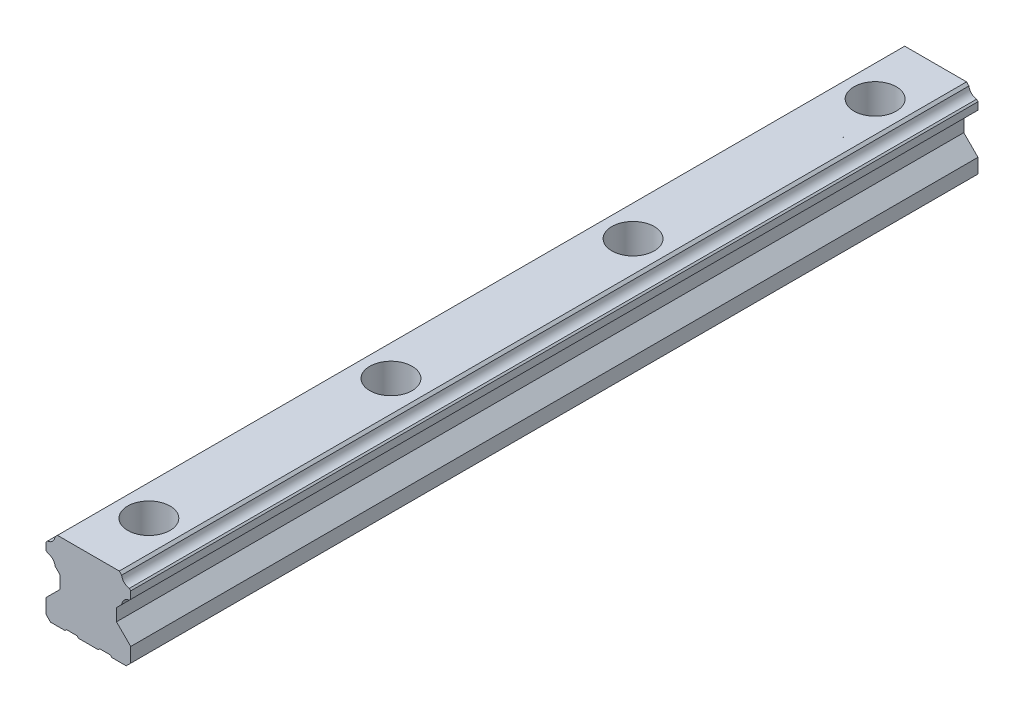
ISO-10303-21;
HEADER;
FILE_DESCRIPTION(('STEP AP214'),'2;1');
FILE_NAME('part.step','',(''),(''),'','','');
FILE_SCHEMA(('AUTOMOTIVE_DESIGN { 1 0 10303 214 1 1 1 1 }'));
ENDSEC;
DATA;
#1=APPLICATION_CONTEXT('core data for automotive mechanical design processes');
#2=APPLICATION_PROTOCOL_DEFINITION('international standard','automotive_design',2000,#1);
#3=PRODUCT_CONTEXT('',#1,'mechanical');
#4=PRODUCT('Part','Part','',(#3));
#5=PRODUCT_RELATED_PRODUCT_CATEGORY('part','',(#4));
#6=PRODUCT_DEFINITION_FORMATION('','',#4);
#7=PRODUCT_DEFINITION_CONTEXT('part definition',#1,'design');
#8=PRODUCT_DEFINITION('design','',#6,#7);
#9=PRODUCT_DEFINITION_SHAPE('','',#8);
#10=(LENGTH_UNIT() NAMED_UNIT(*) SI_UNIT(.MILLI.,.METRE.));
#11=(NAMED_UNIT(*) PLANE_ANGLE_UNIT() SI_UNIT($,.RADIAN.));
#12=(NAMED_UNIT(*) SI_UNIT($,.STERADIAN.) SOLID_ANGLE_UNIT());
#13=UNCERTAINTY_MEASURE_WITH_UNIT(LENGTH_MEASURE(1.E-05),#10,'distance_accuracy_value','');
#14=(GEOMETRIC_REPRESENTATION_CONTEXT(3) GLOBAL_UNCERTAINTY_ASSIGNED_CONTEXT((#13)) GLOBAL_UNIT_ASSIGNED_CONTEXT((#10,
#11,#12)) REPRESENTATION_CONTEXT('',''));
#15=CARTESIAN_POINT('',(0.,0.,0.));
#16=DIRECTION('',(0.,0.,1.));
#17=DIRECTION('',(1.,0.,0.));
#18=AXIS2_PLACEMENT_3D('',#15,#16,#17);
#19=CARTESIAN_POINT('',(-3.25,0.,140.));
#20=DIRECTION('',(0.,1.,0.));
#21=DIRECTION('',(0.,0.,1.));
#22=AXIS2_PLACEMENT_3D('',#19,#20,#21);
#23=PLANE('',#22);
#24=DIRECTION('',(0.,0.,-1.));
#25=VECTOR('',#24,1.);
#26=CARTESIAN_POINT('',(3.25,0.,140.));
#27=LINE('',#26,#25);
#28=CARTESIAN_POINT('',(3.25,0.,-123.112474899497));
#29=VERTEX_POINT('',#28);
#30=CARTESIAN_POINT('',(3.25,0.,-140.));
#31=VERTEX_POINT('',#30);
#32=EDGE_CURVE('E362',#29,#31,#27,.T.);
#33=ORIENTED_EDGE('',*,*,#32,.F.);
#34=CARTESIAN_POINT('',(0.,0.,-120.));
#35=DIRECTION('',(0.,1.,0.));
#36=DIRECTION('',(0.,0.,1.));
#37=AXIS2_PLACEMENT_3D('',#34,#35,#36);
#38=CIRCLE('',#37,4.49999999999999);
#39=CARTESIAN_POINT('',(-3.25,0.,-123.112474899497));
#40=VERTEX_POINT('',#39);
#41=EDGE_CURVE('E346',#29,#40,#38,.T.);
#42=ORIENTED_EDGE('',*,*,#41,.T.);
#43=DIRECTION('',(0.,0.,-1.));
#44=VECTOR('',#43,1.);
#45=CARTESIAN_POINT('',(-3.25,0.,140.));
#46=LINE('',#45,#44);
#47=CARTESIAN_POINT('',(-3.25,0.,-140.));
#48=VERTEX_POINT('',#47);
#49=EDGE_CURVE('E371',#40,#48,#46,.T.);
#50=ORIENTED_EDGE('',*,*,#49,.T.);
#51=DIRECTION('',(1.,0.,0.));
#52=VECTOR('',#51,1.);
#53=CARTESIAN_POINT('',(-3.25,0.,-140.));
#54=LINE('',#53,#52);
#55=EDGE_CURVE('E461',#48,#31,#54,.T.);
#56=ORIENTED_EDGE('',*,*,#55,.T.);
#57=EDGE_LOOP('',(#33,#42,#50,#56));
#58=FACE_BOUND('',#57,.T.);
#59=ADVANCED_FACE('F35',(#58),#23,.F.);
#60=CARTESIAN_POINT('',(-3.25,0.,140.));
#61=DIRECTION('',(0.707106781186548,0.707106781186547,0.));
#62=DIRECTION('',(-0.707106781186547,0.707106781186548,0.));
#63=AXIS2_PLACEMENT_3D('',#60,#61,#62);
#64=PLANE('',#63);
#65=DIRECTION('',(0.,0.,-1.));
#66=VECTOR('',#65,1.);
#67=CARTESIAN_POINT('',(-3.75,0.5,140.));
#68=LINE('',#67,#66);
#69=CARTESIAN_POINT('',(-3.75,0.5,-42.4874685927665));
#70=VERTEX_POINT('',#69);
#71=CARTESIAN_POINT('',(-3.75,0.5,-117.512531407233));
#72=VERTEX_POINT('',#71);
#73=EDGE_CURVE('E872',#70,#72,#68,.T.);
#74=ORIENTED_EDGE('',*,*,#73,.T.);
#75=CARTESIAN_POINT('',(0.,-3.25,-120.));
#76=DIRECTION('',(0.707106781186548,0.707106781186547,0.));
#77=DIRECTION('',(-0.707106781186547,0.707106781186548,0.));
#78=AXIS2_PLACEMENT_3D('',#75,#76,#77);
#79=ELLIPSE('',#78,6.36396103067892,4.5);
#80=CARTESIAN_POINT('',(-3.25,0.,-116.887525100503));
#81=VERTEX_POINT('',#80);
#82=EDGE_CURVE('E875',#72,#81,#79,.T.);
#83=ORIENTED_EDGE('',*,*,#82,.T.);
#84=CARTESIAN_POINT('',(-3.25,0.,-43.1124748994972));
#85=VERTEX_POINT('',#84);
#86=EDGE_CURVE('E355',#85,#81,#46,.T.);
#87=ORIENTED_EDGE('',*,*,#86,.F.);
#88=CARTESIAN_POINT('',(0.,-3.25,-40.));
#89=DIRECTION('',(0.707106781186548,0.707106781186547,0.));
#90=DIRECTION('',(-0.707106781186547,0.707106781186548,0.));
#91=AXIS2_PLACEMENT_3D('',#88,#89,#90);
#92=ELLIPSE('',#91,6.36396103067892,4.5);
#93=EDGE_CURVE('E426',#85,#70,#92,.T.);
#94=ORIENTED_EDGE('',*,*,#93,.T.);
#95=EDGE_LOOP('',(#74,#83,#87,#94));
#96=FACE_BOUND('',#95,.T.);
#97=ADVANCED_FACE('F874',(#96),#64,.F.);
#98=CARTESIAN_POINT('',(3.75,0.5,140.));
#99=DIRECTION('',(-0.707106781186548,0.707106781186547,0.));
#100=DIRECTION('',(-0.707106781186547,-0.707106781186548,0.));
#101=AXIS2_PLACEMENT_3D('',#98,#99,#100);
#102=PLANE('',#101);
#103=DIRECTION('',(0.,0.,-1.));
#104=VECTOR('',#103,1.);
#105=CARTESIAN_POINT('',(3.75,0.5,140.));
#106=LINE('',#105,#104);
#107=CARTESIAN_POINT('',(3.75,0.5,-122.487468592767));
#108=VERTEX_POINT('',#107);
#109=CARTESIAN_POINT('',(3.75,0.5,-140.));
#110=VERTEX_POINT('',#109);
#111=EDGE_CURVE('E563',#108,#110,#106,.T.);
#112=ORIENTED_EDGE('',*,*,#111,.F.);
#113=CARTESIAN_POINT('',(0.,-3.25,-120.));
#114=DIRECTION('',(-0.707106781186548,0.707106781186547,0.));
#115=DIRECTION('',(0.707106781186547,0.707106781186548,0.));
#116=AXIS2_PLACEMENT_3D('',#113,#114,#115);
#117=ELLIPSE('',#116,6.36396103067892,4.5);
#118=EDGE_CURVE('E50',#108,#29,#117,.T.);
#119=ORIENTED_EDGE('',*,*,#118,.T.);
#120=ORIENTED_EDGE('',*,*,#32,.T.);
#121=DIRECTION('',(0.707106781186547,0.707106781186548,0.));
#122=VECTOR('',#121,1.);
#123=CARTESIAN_POINT('',(3.75,0.5,-140.));
#124=LINE('',#123,#122);
#125=EDGE_CURVE('E478',#31,#110,#124,.T.);
#126=ORIENTED_EDGE('',*,*,#125,.T.);
#127=EDGE_LOOP('',(#112,#119,#120,#126));
#128=FACE_BOUND('',#127,.T.);
#129=ADVANCED_FACE('F913',(#128),#102,.F.);
#130=CARTESIAN_POINT('',(3.25,0.,-43.1124748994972));
#131=VERTEX_POINT('',#130);
#132=CARTESIAN_POINT('',(3.25,0.,-116.887525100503));
#133=VERTEX_POINT('',#132);
#134=EDGE_CURVE('E353',#131,#133,#27,.T.);
#135=ORIENTED_EDGE('',*,*,#134,.T.);
#136=CARTESIAN_POINT('',(3.75,0.5,-117.512531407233));
#137=VERTEX_POINT('',#136);
#138=EDGE_CURVE('E337',#133,#137,#117,.T.);
#139=ORIENTED_EDGE('',*,*,#138,.T.);
#140=CARTESIAN_POINT('',(3.75,0.5,-42.4874685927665));
#141=VERTEX_POINT('',#140);
#142=EDGE_CURVE('E568',#141,#137,#106,.T.);
#143=ORIENTED_EDGE('',*,*,#142,.F.);
#144=CARTESIAN_POINT('',(0.,-3.25,-40.));
#145=DIRECTION('',(-0.707106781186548,0.707106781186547,0.));
#146=DIRECTION('',(0.707106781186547,0.707106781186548,0.));
#147=AXIS2_PLACEMENT_3D('',#144,#145,#146);
#148=ELLIPSE('',#147,6.36396103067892,4.5);
#149=EDGE_CURVE('E360',#141,#131,#148,.T.);
#150=ORIENTED_EDGE('',*,*,#149,.T.);
#151=EDGE_LOOP('',(#135,#139,#143,#150));
#152=FACE_BOUND('',#151,.T.);
#153=ADVANCED_FACE('F359',(#152),#102,.F.);
#154=ORIENTED_EDGE('',*,*,#86,.T.);
#155=EDGE_CURVE('E340',#81,#133,#38,.T.);
#156=ORIENTED_EDGE('',*,*,#155,.T.);
#157=ORIENTED_EDGE('',*,*,#134,.F.);
#158=CARTESIAN_POINT('',(0.,0.,-40.));
#159=DIRECTION('',(0.,1.,0.));
#160=DIRECTION('',(0.,0.,1.));
#161=AXIS2_PLACEMENT_3D('',#158,#159,#160);
#162=CIRCLE('',#161,4.49999999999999);
#163=EDGE_CURVE('E892',#131,#85,#162,.T.);
#164=ORIENTED_EDGE('',*,*,#163,.T.);
#165=EDGE_LOOP('',(#154,#156,#157,#164));
#166=FACE_BOUND('',#165,.T.);
#167=ADVANCED_FACE('F351',(#166),#23,.F.);
#168=CARTESIAN_POINT('',(-3.75,0.5,37.5125314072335));
#169=VERTEX_POINT('',#168);
#170=CARTESIAN_POINT('',(-3.75,0.5,-37.5125314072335));
#171=VERTEX_POINT('',#170);
#172=EDGE_CURVE('E870',#169,#171,#68,.T.);
#173=ORIENTED_EDGE('',*,*,#172,.T.);
#174=CARTESIAN_POINT('',(-3.25,0.,-36.8875251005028));
#175=VERTEX_POINT('',#174);
#176=EDGE_CURVE('E43',#171,#175,#92,.T.);
#177=ORIENTED_EDGE('',*,*,#176,.T.);
#178=CARTESIAN_POINT('',(-3.25,0.,36.8875251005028));
#179=VERTEX_POINT('',#178);
#180=EDGE_CURVE('E449',#179,#175,#46,.T.);
#181=ORIENTED_EDGE('',*,*,#180,.F.);
#182=CARTESIAN_POINT('',(0.,-3.25,40.));
#183=DIRECTION('',(0.707106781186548,0.707106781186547,0.));
#184=DIRECTION('',(-0.707106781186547,0.707106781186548,0.));
#185=AXIS2_PLACEMENT_3D('',#182,#183,#184);
#186=ELLIPSE('',#185,6.36396103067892,4.5);
#187=EDGE_CURVE('E422',#179,#169,#186,.T.);
#188=ORIENTED_EDGE('',*,*,#187,.T.);
#189=EDGE_LOOP('',(#173,#177,#181,#188));
#190=FACE_BOUND('',#189,.T.);
#191=ADVANCED_FACE('F894',(#190),#64,.F.);
#192=CARTESIAN_POINT('',(3.25,0.,36.8875251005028));
#193=VERTEX_POINT('',#192);
#194=CARTESIAN_POINT('',(3.25,0.,-36.8875251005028));
#195=VERTEX_POINT('',#194);
#196=EDGE_CURVE('E361',#193,#195,#27,.T.);
#197=ORIENTED_EDGE('',*,*,#196,.T.);
#198=CARTESIAN_POINT('',(3.75,0.5,-37.5125314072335));
#199=VERTEX_POINT('',#198);
#200=EDGE_CURVE('E57',#195,#199,#148,.T.);
#201=ORIENTED_EDGE('',*,*,#200,.T.);
#202=CARTESIAN_POINT('',(3.75,0.5,37.5125314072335));
#203=VERTEX_POINT('',#202);
#204=EDGE_CURVE('E571',#203,#199,#106,.T.);
#205=ORIENTED_EDGE('',*,*,#204,.F.);
#206=CARTESIAN_POINT('',(0.,-3.25,40.));
#207=DIRECTION('',(-0.707106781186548,0.707106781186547,0.));
#208=DIRECTION('',(0.707106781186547,0.707106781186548,0.));
#209=AXIS2_PLACEMENT_3D('',#206,#207,#208);
#210=ELLIPSE('',#209,6.36396103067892,4.5);
#211=EDGE_CURVE('E589',#203,#193,#210,.T.);
#212=ORIENTED_EDGE('',*,*,#211,.T.);
#213=EDGE_LOOP('',(#197,#201,#205,#212));
#214=FACE_BOUND('',#213,.T.);
#215=ADVANCED_FACE('F588',(#214),#102,.F.);
#216=CARTESIAN_POINT('',(-3.75,0.5,117.512531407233));
#217=VERTEX_POINT('',#216);
#218=CARTESIAN_POINT('',(-3.75,0.5,42.4874685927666));
#219=VERTEX_POINT('',#218);
#220=EDGE_CURVE('E382',#217,#219,#68,.T.);
#221=ORIENTED_EDGE('',*,*,#220,.T.);
#222=CARTESIAN_POINT('',(-3.25,0.,43.1124748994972));
#223=VERTEX_POINT('',#222);
#224=EDGE_CURVE('E424',#219,#223,#186,.T.);
#225=ORIENTED_EDGE('',*,*,#224,.T.);
#226=CARTESIAN_POINT('',(-3.25,0.,116.887525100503));
#227=VERTEX_POINT('',#226);
#228=EDGE_CURVE('E377',#227,#223,#46,.T.);
#229=ORIENTED_EDGE('',*,*,#228,.F.);
#230=CARTESIAN_POINT('',(0.,-3.25,120.));
#231=DIRECTION('',(0.707106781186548,0.707106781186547,0.));
#232=DIRECTION('',(-0.707106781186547,0.707106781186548,0.));
#233=AXIS2_PLACEMENT_3D('',#230,#231,#232);
#234=ELLIPSE('',#233,6.36396103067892,4.5);
#235=EDGE_CURVE('E621',#227,#217,#234,.T.);
#236=ORIENTED_EDGE('',*,*,#235,.T.);
#237=EDGE_LOOP('',(#221,#225,#229,#236));
#238=FACE_BOUND('',#237,.T.);
#239=ADVANCED_FACE('F437',(#238),#64,.F.);
#240=ORIENTED_EDGE('',*,*,#180,.T.);
#241=EDGE_CURVE('E891',#175,#195,#162,.T.);
#242=ORIENTED_EDGE('',*,*,#241,.T.);
#243=ORIENTED_EDGE('',*,*,#196,.F.);
#244=CARTESIAN_POINT('',(0.,0.,40.));
#245=DIRECTION('',(0.,1.,0.));
#246=DIRECTION('',(0.,0.,1.));
#247=AXIS2_PLACEMENT_3D('',#244,#245,#246);
#248=CIRCLE('',#247,4.49999999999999);
#249=EDGE_CURVE('E425',#193,#179,#248,.T.);
#250=ORIENTED_EDGE('',*,*,#249,.T.);
#251=EDGE_LOOP('',(#240,#242,#243,#250));
#252=FACE_BOUND('',#251,.T.);
#253=ADVANCED_FACE('F896',(#252),#23,.F.);
#254=CARTESIAN_POINT('',(3.25,0.,116.887525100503));
#255=VERTEX_POINT('',#254);
#256=CARTESIAN_POINT('',(3.25,0.,43.1124748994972));
#257=VERTEX_POINT('',#256);
#258=EDGE_CURVE('E365',#255,#257,#27,.T.);
#259=ORIENTED_EDGE('',*,*,#258,.T.);
#260=CARTESIAN_POINT('',(3.75,0.5,42.4874685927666));
#261=VERTEX_POINT('',#260);
#262=EDGE_CURVE('E608',#257,#261,#210,.T.);
#263=ORIENTED_EDGE('',*,*,#262,.T.);
#264=CARTESIAN_POINT('',(3.75,0.5,117.512531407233));
#265=VERTEX_POINT('',#264);
#266=EDGE_CURVE('E573',#265,#261,#106,.T.);
#267=ORIENTED_EDGE('',*,*,#266,.F.);
#268=CARTESIAN_POINT('',(0.,-3.25,120.));
#269=DIRECTION('',(-0.707106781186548,0.707106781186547,0.));
#270=DIRECTION('',(0.707106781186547,0.707106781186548,0.));
#271=AXIS2_PLACEMENT_3D('',#268,#269,#270);
#272=ELLIPSE('',#271,6.36396103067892,4.5);
#273=EDGE_CURVE('E632',#265,#255,#272,.T.);
#274=ORIENTED_EDGE('',*,*,#273,.T.);
#275=EDGE_LOOP('',(#259,#263,#267,#274));
#276=FACE_BOUND('',#275,.T.);
#277=ADVANCED_FACE('F898',(#276),#102,.F.);
#278=CARTESIAN_POINT('',(-3.75,0.5,140.));
#279=VERTEX_POINT('',#278);
#280=CARTESIAN_POINT('',(-3.75,0.5,122.487468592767));
#281=VERTEX_POINT('',#280);
#282=EDGE_CURVE('E378',#279,#281,#68,.T.);
#283=ORIENTED_EDGE('',*,*,#282,.T.);
#284=CARTESIAN_POINT('',(-3.25,0.,123.112474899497));
#285=VERTEX_POINT('',#284);
#286=EDGE_CURVE('E624',#281,#285,#234,.T.);
#287=ORIENTED_EDGE('',*,*,#286,.T.);
#288=CARTESIAN_POINT('',(-3.25,0.,140.));
#289=VERTEX_POINT('',#288);
#290=EDGE_CURVE('E373',#289,#285,#46,.T.);
#291=ORIENTED_EDGE('',*,*,#290,.F.);
#292=DIRECTION('',(0.707106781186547,-0.707106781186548,0.));
#293=VECTOR('',#292,1.);
#294=CARTESIAN_POINT('',(-3.25,0.,140.));
#295=LINE('',#294,#293);
#296=EDGE_CURVE('E659',#279,#289,#295,.T.);
#297=ORIENTED_EDGE('',*,*,#296,.F.);
#298=EDGE_LOOP('',(#283,#287,#291,#297));
#299=FACE_BOUND('',#298,.T.);
#300=ADVANCED_FACE('F867',(#299),#64,.F.);
#301=ORIENTED_EDGE('',*,*,#228,.T.);
#302=EDGE_CURVE('E447',#223,#257,#248,.T.);
#303=ORIENTED_EDGE('',*,*,#302,.T.);
#304=ORIENTED_EDGE('',*,*,#258,.F.);
#305=CARTESIAN_POINT('',(0.,0.,120.));
#306=DIRECTION('',(0.,1.,0.));
#307=DIRECTION('',(0.,0.,1.));
#308=AXIS2_PLACEMENT_3D('',#305,#306,#307);
#309=CIRCLE('',#308,4.5);
#310=EDGE_CURVE('E421',#255,#227,#309,.T.);
#311=ORIENTED_EDGE('',*,*,#310,.T.);
#312=EDGE_LOOP('',(#301,#303,#304,#311));
#313=FACE_BOUND('',#312,.T.);
#314=ADVANCED_FACE('F445',(#313),#23,.F.);
#315=CARTESIAN_POINT('',(-13.8696289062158,25.5598144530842,140.));
#316=DIRECTION('',(0.,0.,-1.));
#317=DIRECTION('',(-1.,0.,0.));
#318=AXIS2_PLACEMENT_3D('',#315,#316,#317);
#319=CYLINDRICAL_SURFACE('',#318,2.88999938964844);
#320=CARTESIAN_POINT('',(-13.8696289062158,25.5598144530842,-140.));
#321=DIRECTION('',(0.,0.,-1.));
#322=DIRECTION('',(1.,0.,0.));
#323=AXIS2_PLACEMENT_3D('',#320,#321,#322);
#324=CIRCLE('',#323,2.88999938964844);
#325=CARTESIAN_POINT('',(-11.000310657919,25.2146923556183,-140.));
#326=VERTEX_POINT('',#325);
#327=CARTESIAN_POINT('',(-13.5245057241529,22.6904963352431,-140.));
#328=VERTEX_POINT('',#327);
#329=EDGE_CURVE('E696',#326,#328,#324,.T.);
#330=ORIENTED_EDGE('',*,*,#329,.T.);
#331=DIRECTION('',(0.,0.,-1.));
#332=VECTOR('',#331,1.);
#333=CARTESIAN_POINT('',(-13.5245057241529,22.6904963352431,140.));
#334=LINE('',#333,#332);
#335=CARTESIAN_POINT('',(-13.5245057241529,22.6904963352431,140.));
#336=VERTEX_POINT('',#335);
#337=EDGE_CURVE('E415',#336,#328,#334,.T.);
#338=ORIENTED_EDGE('',*,*,#337,.F.);
#339=CARTESIAN_POINT('',(-13.8696289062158,25.5598144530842,140.));
#340=DIRECTION('',(0.,0.,-1.));
#341=DIRECTION('',(1.,0.,0.));
#342=AXIS2_PLACEMENT_3D('',#339,#340,#341);
#343=CIRCLE('',#342,2.88999938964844);
#344=CARTESIAN_POINT('',(-11.000310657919,25.2146923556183,140.));
#345=VERTEX_POINT('',#344);
#346=EDGE_CURVE('E515',#345,#336,#343,.T.);
#347=ORIENTED_EDGE('',*,*,#346,.F.);
#348=DIRECTION('',(0.,0.,-1.));
#349=VECTOR('',#348,1.);
#350=CARTESIAN_POINT('',(-11.000310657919,25.2146923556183,140.));
#351=LINE('',#350,#349);
#352=EDGE_CURVE('E516',#345,#326,#351,.T.);
#353=ORIENTED_EDGE('',*,*,#352,.T.);
#354=EDGE_LOOP('',(#330,#338,#347,#353));
#355=FACE_BOUND('',#354,.T.);
#356=ADVANCED_FACE('F37',(#355),#319,.F.);
#357=CARTESIAN_POINT('',(-14.0000000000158,22.2150030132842,140.));
#358=DIRECTION('',(0.707106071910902,-0.707107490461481,0.));
#359=DIRECTION('',(0.707107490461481,0.707106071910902,0.));
#360=AXIS2_PLACEMENT_3D('',#357,#358,#359);
#361=PLANE('',#360);
#362=DIRECTION('',(-0.707107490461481,-0.707106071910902,0.));
#363=VECTOR('',#362,1.);
#364=CARTESIAN_POINT('',(-14.0000000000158,22.2150030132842,-140.));
#365=LINE('',#364,#363);
#366=CARTESIAN_POINT('',(-14.0000000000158,22.2150030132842,-140.));
#367=VERTEX_POINT('',#366);
#368=EDGE_CURVE('E699',#328,#367,#365,.T.);
#369=ORIENTED_EDGE('',*,*,#368,.T.);
#370=DIRECTION('',(0.,0.,-1.));
#371=VECTOR('',#370,1.);
#372=CARTESIAN_POINT('',(-14.0000000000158,22.2150030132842,140.));
#373=LINE('',#372,#371);
#374=CARTESIAN_POINT('',(-14.0000000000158,22.2150030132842,140.));
#375=VERTEX_POINT('',#374);
#376=EDGE_CURVE('E412',#375,#367,#373,.T.);
#377=ORIENTED_EDGE('',*,*,#376,.F.);
#378=DIRECTION('',(-0.707107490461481,-0.707106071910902,0.));
#379=VECTOR('',#378,1.);
#380=CARTESIAN_POINT('',(-14.0000000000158,22.2150030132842,140.));
#381=LINE('',#380,#379);
#382=EDGE_CURVE('E635',#336,#375,#381,.T.);
#383=ORIENTED_EDGE('',*,*,#382,.F.);
#384=ORIENTED_EDGE('',*,*,#337,.T.);
#385=EDGE_LOOP('',(#369,#377,#383,#384));
#386=FACE_BOUND('',#385,.T.);
#387=ADVANCED_FACE('F776',(#386),#361,.F.);
#388=CARTESIAN_POINT('',(-14.0000000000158,22.2150030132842,140.));
#389=DIRECTION('',(1.,0.,0.));
#390=DIRECTION('',(0.,0.,-1.));
#391=AXIS2_PLACEMENT_3D('',#388,#389,#390);
#392=PLANE('',#391);
#393=DIRECTION('',(0.,-1.,0.));
#394=VECTOR('',#393,1.);
#395=CARTESIAN_POINT('',(-14.0000000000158,22.2150030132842,-140.));
#396=LINE('',#395,#394);
#397=CARTESIAN_POINT('',(-14.0000000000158,19.7791481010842,-140.));
#398=VERTEX_POINT('',#397);
#399=EDGE_CURVE('E701',#367,#398,#396,.T.);
#400=ORIENTED_EDGE('',*,*,#399,.T.);
#401=DIRECTION('',(0.,0.,-1.));
#402=VECTOR('',#401,1.);
#403=CARTESIAN_POINT('',(-14.0000000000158,19.7791481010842,140.));
#404=LINE('',#403,#402);
#405=CARTESIAN_POINT('',(-14.0000000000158,19.7791481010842,140.));
#406=VERTEX_POINT('',#405);
#407=EDGE_CURVE('E409',#406,#398,#404,.T.);
#408=ORIENTED_EDGE('',*,*,#407,.F.);
#409=DIRECTION('',(0.,-1.,0.));
#410=VECTOR('',#409,1.);
#411=CARTESIAN_POINT('',(-14.0000000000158,22.2150030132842,140.));
#412=LINE('',#411,#410);
#413=EDGE_CURVE('E637',#375,#406,#412,.T.);
#414=ORIENTED_EDGE('',*,*,#413,.F.);
#415=ORIENTED_EDGE('',*,*,#376,.T.);
#416=EDGE_LOOP('',(#400,#408,#414,#415));
#417=FACE_BOUND('',#416,.T.);
#418=ADVANCED_FACE('F772',(#417),#392,.F.);
#419=CARTESIAN_POINT('',(-13.5308708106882,19.3100179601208,140.));
#420=DIRECTION('',(0.707107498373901,0.707106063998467,0.));
#421=DIRECTION('',(-0.707106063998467,0.707107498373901,0.));
#422=AXIS2_PLACEMENT_3D('',#419,#420,#421);
#423=PLANE('',#422);
#424=DIRECTION('',(0.707106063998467,-0.707107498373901,0.));
#425=VECTOR('',#424,1.);
#426=CARTESIAN_POINT('',(-13.5308708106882,19.3100179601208,-140.));
#427=LINE('',#426,#425);
#428=CARTESIAN_POINT('',(-13.5308708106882,19.3100179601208,-140.));
#429=VERTEX_POINT('',#428);
#430=EDGE_CURVE('E703',#398,#429,#427,.T.);
#431=ORIENTED_EDGE('',*,*,#430,.T.);
#432=DIRECTION('',(0.,0.,-1.));
#433=VECTOR('',#432,1.);
#434=CARTESIAN_POINT('',(-13.5308708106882,19.3100179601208,140.));
#435=LINE('',#434,#433);
#436=CARTESIAN_POINT('',(-13.5308708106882,19.3100179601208,140.));
#437=VERTEX_POINT('',#436);
#438=EDGE_CURVE('E406',#437,#429,#435,.T.);
#439=ORIENTED_EDGE('',*,*,#438,.F.);
#440=DIRECTION('',(0.707106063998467,-0.707107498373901,0.));
#441=VECTOR('',#440,1.);
#442=CARTESIAN_POINT('',(-13.5308708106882,19.3100179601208,140.));
#443=LINE('',#442,#441);
#444=EDGE_CURVE('E639',#406,#437,#443,.T.);
#445=ORIENTED_EDGE('',*,*,#444,.F.);
#446=ORIENTED_EDGE('',*,*,#407,.T.);
#447=EDGE_LOOP('',(#431,#439,#445,#446));
#448=FACE_BOUND('',#447,.T.);
#449=ADVANCED_FACE('F768',(#448),#423,.F.);
#450=CARTESIAN_POINT('',(-13.8696289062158,16.4399414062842,140.));
#451=DIRECTION('',(0.,0.,-1.));
#452=DIRECTION('',(-1.,0.,0.));
#453=AXIS2_PLACEMENT_3D('',#450,#451,#452);
#454=CYLINDRICAL_SURFACE('',#453,2.88999938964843);
#455=CARTESIAN_POINT('',(-13.8696289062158,16.4399414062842,-140.));
#456=DIRECTION('',(0.,0.,-1.));
#457=DIRECTION('',(1.,0.,0.));
#458=AXIS2_PLACEMENT_3D('',#455,#456,#457);
#459=CIRCLE('',#458,2.88999938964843);
#460=CARTESIAN_POINT('',(-10.9995523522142,16.7786995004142,-140.));
#461=VERTEX_POINT('',#460);
#462=EDGE_CURVE('E705',#429,#461,#459,.T.);
#463=ORIENTED_EDGE('',*,*,#462,.T.);
#464=DIRECTION('',(0.,0.,-1.));
#465=VECTOR('',#464,1.);
#466=CARTESIAN_POINT('',(-10.9995523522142,16.7786995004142,140.));
#467=LINE('',#466,#465);
#468=CARTESIAN_POINT('',(-10.9995523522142,16.7786995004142,140.));
#469=VERTEX_POINT('',#468);
#470=EDGE_CURVE('E403',#469,#461,#467,.T.);
#471=ORIENTED_EDGE('',*,*,#470,.F.);
#472=CARTESIAN_POINT('',(-13.8696289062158,16.4399414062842,140.));
#473=DIRECTION('',(0.,0.,-1.));
#474=DIRECTION('',(1.,0.,0.));
#475=AXIS2_PLACEMENT_3D('',#472,#473,#474);
#476=CIRCLE('',#475,2.88999938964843);
#477=EDGE_CURVE('E641',#437,#469,#476,.T.);
#478=ORIENTED_EDGE('',*,*,#477,.F.);
#479=ORIENTED_EDGE('',*,*,#438,.T.);
#480=EDGE_LOOP('',(#463,#471,#478,#479));
#481=FACE_BOUND('',#480,.T.);
#482=ADVANCED_FACE('F764',(#481),#454,.F.);
#483=CARTESIAN_POINT('',(-10.9995523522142,16.7786995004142,140.));
#484=DIRECTION('',(0.707106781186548,0.707106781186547,0.));
#485=DIRECTION('',(-0.707106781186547,0.707106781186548,0.));
#486=AXIS2_PLACEMENT_3D('',#483,#484,#485);
#487=PLANE('',#486);
#488=DIRECTION('',(0.707106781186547,-0.707106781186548,0.));
#489=VECTOR('',#488,1.);
#490=CARTESIAN_POINT('',(-10.9995523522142,16.7786995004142,-140.));
#491=LINE('',#490,#489);
#492=CARTESIAN_POINT('',(-9.3002929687,15.0794401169,-140.));
#493=VERTEX_POINT('',#492);
#494=EDGE_CURVE('E707',#461,#493,#491,.T.);
#495=ORIENTED_EDGE('',*,*,#494,.T.);
#496=DIRECTION('',(0.,0.,-1.));
#497=VECTOR('',#496,1.);
#498=CARTESIAN_POINT('',(-9.3002929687,15.0794401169,140.));
#499=LINE('',#498,#497);
#500=CARTESIAN_POINT('',(-9.3002929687,15.0794401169,140.));
#501=VERTEX_POINT('',#500);
#502=EDGE_CURVE('E400',#501,#493,#499,.T.);
#503=ORIENTED_EDGE('',*,*,#502,.F.);
#504=DIRECTION('',(0.707106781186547,-0.707106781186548,0.));
#505=VECTOR('',#504,1.);
#506=CARTESIAN_POINT('',(-10.9995523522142,16.7786995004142,140.));
#507=LINE('',#506,#505);
#508=EDGE_CURVE('E643',#469,#501,#507,.T.);
#509=ORIENTED_EDGE('',*,*,#508,.F.);
#510=ORIENTED_EDGE('',*,*,#470,.T.);
#511=EDGE_LOOP('',(#495,#503,#509,#510));
#512=FACE_BOUND('',#511,.T.);
#513=ADVANCED_FACE('F759',(#512),#487,.F.);
#514=CARTESIAN_POINT('',(-9.3002929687,15.0794401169,140.));
#515=DIRECTION('',(1.,0.,0.));
#516=DIRECTION('',(0.,0.,-1.));
#517=AXIS2_PLACEMENT_3D('',#514,#515,#516);
#518=PLANE('',#517);
#519=DIRECTION('',(0.,-1.,0.));
#520=VECTOR('',#519,1.);
#521=CARTESIAN_POINT('',(-9.3002929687,15.0794401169,-140.));
#522=LINE('',#521,#520);
#523=CARTESIAN_POINT('',(-9.3002929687,10.999628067,-140.));
#524=VERTEX_POINT('',#523);
#525=EDGE_CURVE('E709',#493,#524,#522,.T.);
#526=ORIENTED_EDGE('',*,*,#525,.T.);
#527=DIRECTION('',(0.,0.,-1.));
#528=VECTOR('',#527,1.);
#529=CARTESIAN_POINT('',(-9.3002929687,10.999628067,140.));
#530=LINE('',#529,#528);
#531=CARTESIAN_POINT('',(-9.3002929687,10.999628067,140.));
#532=VERTEX_POINT('',#531);
#533=EDGE_CURVE('E397',#532,#524,#530,.T.);
#534=ORIENTED_EDGE('',*,*,#533,.F.);
#535=DIRECTION('',(0.,-1.,0.));
#536=VECTOR('',#535,1.);
#537=CARTESIAN_POINT('',(-9.3002929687,15.0794401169,140.));
#538=LINE('',#537,#536);
#539=EDGE_CURVE('E645',#501,#532,#538,.T.);
#540=ORIENTED_EDGE('',*,*,#539,.F.);
#541=ORIENTED_EDGE('',*,*,#502,.T.);
#542=EDGE_LOOP('',(#526,#534,#540,#541));
#543=FACE_BOUND('',#542,.T.);
#544=ADVANCED_FACE('F753',(#543),#518,.F.);
#545=CARTESIAN_POINT('',(-9.3002929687,10.999628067,140.));
#546=DIRECTION('',(0.707100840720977,-0.707112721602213,0.));
#547=DIRECTION('',(0.707112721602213,0.707100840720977,0.));
#548=AXIS2_PLACEMENT_3D('',#545,#546,#547);
#549=PLANE('',#548);
#550=DIRECTION('',(-0.707112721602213,-0.707100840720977,0.));
#551=VECTOR('',#550,1.);
#552=CARTESIAN_POINT('',(-9.3002929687,10.999628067,-140.));
#553=LINE('',#552,#551);
#554=CARTESIAN_POINT('',(-14.,6.3,-140.));
#555=VERTEX_POINT('',#554);
#556=EDGE_CURVE('E711',#524,#555,#553,.T.);
#557=ORIENTED_EDGE('',*,*,#556,.T.);
#558=DIRECTION('',(0.,0.,-1.));
#559=VECTOR('',#558,1.);
#560=CARTESIAN_POINT('',(-14.,6.3,140.));
#561=LINE('',#560,#559);
#562=CARTESIAN_POINT('',(-14.,6.3,140.));
#563=VERTEX_POINT('',#562);
#564=EDGE_CURVE('E394',#563,#555,#561,.T.);
#565=ORIENTED_EDGE('',*,*,#564,.F.);
#566=DIRECTION('',(-0.707112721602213,-0.707100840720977,0.));
#567=VECTOR('',#566,1.);
#568=CARTESIAN_POINT('',(-9.3002929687,10.999628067,140.));
#569=LINE('',#568,#567);
#570=EDGE_CURVE('E647',#532,#563,#569,.T.);
#571=ORIENTED_EDGE('',*,*,#570,.F.);
#572=ORIENTED_EDGE('',*,*,#533,.T.);
#573=EDGE_LOOP('',(#557,#565,#571,#572));
#574=FACE_BOUND('',#573,.T.);
#575=ADVANCED_FACE('F749',(#574),#549,.F.);
#576=CARTESIAN_POINT('',(-14.,6.3,140.));
#577=DIRECTION('',(1.,0.,0.));
#578=DIRECTION('',(0.,0.,-1.));
#579=AXIS2_PLACEMENT_3D('',#576,#577,#578);
#580=PLANE('',#579);
#581=DIRECTION('',(0.,-1.,0.));
#582=VECTOR('',#581,1.);
#583=CARTESIAN_POINT('',(-14.,6.3,-140.));
#584=LINE('',#583,#582);
#585=CARTESIAN_POINT('',(-14.,1.5,-140.));
#586=VERTEX_POINT('',#585);
#587=EDGE_CURVE('E713',#555,#586,#584,.T.);
#588=ORIENTED_EDGE('',*,*,#587,.T.);
#589=DIRECTION('',(0.,0.,-1.));
#590=VECTOR('',#589,1.);
#591=CARTESIAN_POINT('',(-14.,1.5,140.));
#592=LINE('',#591,#590);
#593=CARTESIAN_POINT('',(-14.,1.5,140.));
#594=VERTEX_POINT('',#593);
#595=EDGE_CURVE('E391',#594,#586,#592,.T.);
#596=ORIENTED_EDGE('',*,*,#595,.F.);
#597=DIRECTION('',(0.,-1.,0.));
#598=VECTOR('',#597,1.);
#599=CARTESIAN_POINT('',(-14.,6.3,140.));
#600=LINE('',#599,#598);
#601=EDGE_CURVE('E649',#563,#594,#600,.T.);
#602=ORIENTED_EDGE('',*,*,#601,.F.);
#603=ORIENTED_EDGE('',*,*,#564,.T.);
#604=EDGE_LOOP('',(#588,#596,#602,#603));
#605=FACE_BOUND('',#604,.T.);
#606=ADVANCED_FACE('F744',(#605),#580,.F.);
#607=CARTESIAN_POINT('',(-14.,1.5,140.));
#608=DIRECTION('',(0.707106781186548,0.707106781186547,0.));
#609=DIRECTION('',(-0.707106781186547,0.707106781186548,0.));
#610=AXIS2_PLACEMENT_3D('',#607,#608,#609);
#611=PLANE('',#610);
#612=DIRECTION('',(0.707106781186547,-0.707106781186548,0.));
#613=VECTOR('',#612,1.);
#614=CARTESIAN_POINT('',(-14.,1.5,-140.));
#615=LINE('',#614,#613);
#616=CARTESIAN_POINT('',(-12.5,0.,-140.));
#617=VERTEX_POINT('',#616);
#618=EDGE_CURVE('E715',#586,#617,#615,.T.);
#619=ORIENTED_EDGE('',*,*,#618,.T.);
#620=DIRECTION('',(0.,0.,-1.));
#621=VECTOR('',#620,1.);
#622=CARTESIAN_POINT('',(-12.5,0.,140.));
#623=LINE('',#622,#621);
#624=CARTESIAN_POINT('',(-12.5,0.,140.));
#625=VERTEX_POINT('',#624);
#626=EDGE_CURVE('E388',#625,#617,#623,.T.);
#627=ORIENTED_EDGE('',*,*,#626,.F.);
#628=DIRECTION('',(0.707106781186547,-0.707106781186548,0.));
#629=VECTOR('',#628,1.);
#630=CARTESIAN_POINT('',(-14.,1.5,140.));
#631=LINE('',#630,#629);
#632=EDGE_CURVE('E651',#594,#625,#631,.T.);
#633=ORIENTED_EDGE('',*,*,#632,.F.);
#634=ORIENTED_EDGE('',*,*,#595,.T.);
#635=EDGE_LOOP('',(#619,#627,#633,#634));
#636=FACE_BOUND('',#635,.T.);
#637=ADVANCED_FACE('F738',(#636),#611,.F.);
#638=CARTESIAN_POINT('',(-12.5,0.,140.));
#639=DIRECTION('',(0.,1.,0.));
#640=DIRECTION('',(0.,0.,1.));
#641=AXIS2_PLACEMENT_3D('',#638,#639,#640);
#642=PLANE('',#641);
#643=DIRECTION('',(1.,0.,0.));
#644=VECTOR('',#643,1.);
#645=CARTESIAN_POINT('',(-12.5,0.,-140.));
#646=LINE('',#645,#644);
#647=CARTESIAN_POINT('',(-7.75,0.,-140.));
#648=VERTEX_POINT('',#647);
#649=EDGE_CURVE('E717',#617,#648,#646,.T.);
#650=ORIENTED_EDGE('',*,*,#649,.T.);
#651=DIRECTION('',(0.,0.,-1.));
#652=VECTOR('',#651,1.);
#653=CARTESIAN_POINT('',(-7.75,0.,140.));
#654=LINE('',#653,#652);
#655=CARTESIAN_POINT('',(-7.75,0.,140.));
#656=VERTEX_POINT('',#655);
#657=EDGE_CURVE('E385',#656,#648,#654,.T.);
#658=ORIENTED_EDGE('',*,*,#657,.F.);
#659=DIRECTION('',(1.,0.,0.));
#660=VECTOR('',#659,1.);
#661=CARTESIAN_POINT('',(-12.5,0.,140.));
#662=LINE('',#661,#660);
#663=EDGE_CURVE('E653',#625,#656,#662,.T.);
#664=ORIENTED_EDGE('',*,*,#663,.F.);
#665=ORIENTED_EDGE('',*,*,#626,.T.);
#666=EDGE_LOOP('',(#650,#658,#664,#665));
#667=FACE_BOUND('',#666,.T.);
#668=ADVANCED_FACE('F734',(#667),#642,.F.);
#669=CARTESIAN_POINT('',(-7.25,0.5,140.));
#670=DIRECTION('',(-0.707106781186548,0.707106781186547,0.));
#671=DIRECTION('',(-0.707106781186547,-0.707106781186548,0.));
#672=AXIS2_PLACEMENT_3D('',#669,#670,#671);
#673=PLANE('',#672);
#674=DIRECTION('',(0.707106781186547,0.707106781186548,0.));
#675=VECTOR('',#674,1.);
#676=CARTESIAN_POINT('',(-7.25,0.5,-140.));
#677=LINE('',#676,#675);
#678=CARTESIAN_POINT('',(-7.25,0.5,-140.));
#679=VERTEX_POINT('',#678);
#680=EDGE_CURVE('E719',#648,#679,#677,.T.);
#681=ORIENTED_EDGE('',*,*,#680,.T.);
#682=DIRECTION('',(0.,0.,-1.));
#683=VECTOR('',#682,1.);
#684=CARTESIAN_POINT('',(-7.25,0.5,140.));
#685=LINE('',#684,#683);
#686=CARTESIAN_POINT('',(-7.25,0.5,140.));
#687=VERTEX_POINT('',#686);
#688=EDGE_CURVE('E381',#687,#679,#685,.T.);
#689=ORIENTED_EDGE('',*,*,#688,.F.);
#690=DIRECTION('',(0.707106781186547,0.707106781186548,0.));
#691=VECTOR('',#690,1.);
#692=CARTESIAN_POINT('',(-7.25,0.5,140.));
#693=LINE('',#692,#691);
#694=EDGE_CURVE('E655',#656,#687,#693,.T.);
#695=ORIENTED_EDGE('',*,*,#694,.F.);
#696=ORIENTED_EDGE('',*,*,#657,.T.);
#697=EDGE_LOOP('',(#681,#689,#695,#696));
#698=FACE_BOUND('',#697,.T.);
#699=ADVANCED_FACE('F729',(#698),#673,.F.);
#700=CARTESIAN_POINT('',(-7.25,0.5,140.));
#701=DIRECTION('',(0.,1.,0.));
#702=DIRECTION('',(0.,0.,1.));
#703=AXIS2_PLACEMENT_3D('',#700,#701,#702);
#704=PLANE('',#703);
#705=CARTESIAN_POINT('',(-3.75,0.5,-122.487468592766));
#706=VERTEX_POINT('',#705);
#707=CARTESIAN_POINT('',(-3.75,0.5,-140.));
#708=VERTEX_POINT('',#707);
#709=EDGE_CURVE('E376',#706,#708,#68,.T.);
#710=ORIENTED_EDGE('',*,*,#709,.F.);
#711=CARTESIAN_POINT('',(0.,0.5,-120.));
#712=DIRECTION('',(0.,1.,0.));
#713=DIRECTION('',(0.,0.,1.));
#714=AXIS2_PLACEMENT_3D('',#711,#712,#713);
#715=CIRCLE('',#714,4.5);
#716=EDGE_CURVE('E877',#706,#72,#715,.T.);
#717=ORIENTED_EDGE('',*,*,#716,.T.);
#718=ORIENTED_EDGE('',*,*,#73,.F.);
#719=CARTESIAN_POINT('',(0.,0.5,-40.));
#720=DIRECTION('',(0.,1.,0.));
#721=DIRECTION('',(0.,0.,1.));
#722=AXIS2_PLACEMENT_3D('',#719,#720,#721);
#723=CIRCLE('',#722,4.5);
#724=EDGE_CURVE('E593',#70,#171,#723,.T.);
#725=ORIENTED_EDGE('',*,*,#724,.T.);
#726=ORIENTED_EDGE('',*,*,#172,.F.);
#727=CARTESIAN_POINT('',(0.,0.5,40.));
#728=DIRECTION('',(0.,1.,0.));
#729=DIRECTION('',(0.,0.,1.));
#730=AXIS2_PLACEMENT_3D('',#727,#728,#729);
#731=CIRCLE('',#730,4.5);
#732=EDGE_CURVE('E605',#169,#219,#731,.T.);
#733=ORIENTED_EDGE('',*,*,#732,.T.);
#734=ORIENTED_EDGE('',*,*,#220,.F.);
#735=CARTESIAN_POINT('',(0.,0.5,120.));
#736=DIRECTION('',(0.,1.,0.));
#737=DIRECTION('',(0.,0.,1.));
#738=AXIS2_PLACEMENT_3D('',#735,#736,#737);
#739=CIRCLE('',#738,4.5);
#740=EDGE_CURVE('E623',#217,#281,#739,.T.);
#741=ORIENTED_EDGE('',*,*,#740,.T.);
#742=ORIENTED_EDGE('',*,*,#282,.F.);
#743=DIRECTION('',(1.,0.,0.));
#744=VECTOR('',#743,1.);
#745=CARTESIAN_POINT('',(-7.25,0.5,140.));
#746=LINE('',#745,#744);
#747=EDGE_CURVE('E657',#687,#279,#746,.T.);
#748=ORIENTED_EDGE('',*,*,#747,.F.);
#749=ORIENTED_EDGE('',*,*,#688,.T.);
#750=DIRECTION('',(1.,0.,0.));
#751=VECTOR('',#750,1.);
#752=CARTESIAN_POINT('',(-7.25,0.5,-140.));
#753=LINE('',#752,#751);
#754=EDGE_CURVE('E472',#679,#708,#753,.T.);
#755=ORIENTED_EDGE('',*,*,#754,.T.);
#756=EDGE_LOOP('',(#710,#717,#718,#725,#726,#733,#734,#741,#742,#748,#749,#755));
#757=FACE_BOUND('',#756,.T.);
#758=ADVANCED_FACE('F721',(#757),#704,.F.);
#759=ORIENTED_EDGE('',*,*,#49,.F.);
#760=EDGE_CURVE('E878',#40,#706,#79,.T.);
#761=ORIENTED_EDGE('',*,*,#760,.T.);
#762=ORIENTED_EDGE('',*,*,#709,.T.);
#763=DIRECTION('',(0.707106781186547,-0.707106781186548,0.));
#764=VECTOR('',#763,1.);
#765=CARTESIAN_POINT('',(-3.25,0.,-140.));
#766=LINE('',#765,#764);
#767=EDGE_CURVE('E466',#708,#48,#766,.T.);
#768=ORIENTED_EDGE('',*,*,#767,.T.);
#769=EDGE_LOOP('',(#759,#761,#762,#768));
#770=FACE_BOUND('',#769,.T.);
#771=ADVANCED_FACE('F467',(#770),#64,.F.);
#772=ORIENTED_EDGE('',*,*,#290,.T.);
#773=CARTESIAN_POINT('',(3.25,0.,123.112474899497));
#774=VERTEX_POINT('',#773);
#775=EDGE_CURVE('E418',#285,#774,#309,.T.);
#776=ORIENTED_EDGE('',*,*,#775,.T.);
#777=CARTESIAN_POINT('',(3.25,0.,140.));
#778=VERTEX_POINT('',#777);
#779=EDGE_CURVE('E367',#778,#774,#27,.T.);
#780=ORIENTED_EDGE('',*,*,#779,.F.);
#781=DIRECTION('',(1.,0.,0.));
#782=VECTOR('',#781,1.);
#783=CARTESIAN_POINT('',(-3.25,0.,140.));
#784=LINE('',#783,#782);
#785=EDGE_CURVE('E661',#289,#778,#784,.T.);
#786=ORIENTED_EDGE('',*,*,#785,.F.);
#787=EDGE_LOOP('',(#772,#776,#780,#786));
#788=FACE_BOUND('',#787,.T.);
#789=ADVANCED_FACE('F863',(#788),#23,.F.);
#790=ORIENTED_EDGE('',*,*,#779,.T.);
#791=CARTESIAN_POINT('',(3.75,0.5,122.487468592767));
#792=VERTEX_POINT('',#791);
#793=EDGE_CURVE('E629',#774,#792,#272,.T.);
#794=ORIENTED_EDGE('',*,*,#793,.T.);
#795=CARTESIAN_POINT('',(3.75,0.5,140.));
#796=VERTEX_POINT('',#795);
#797=EDGE_CURVE('E366',#796,#792,#106,.T.);
#798=ORIENTED_EDGE('',*,*,#797,.F.);
#799=DIRECTION('',(0.707106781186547,0.707106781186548,0.));
#800=VECTOR('',#799,1.);
#801=CARTESIAN_POINT('',(3.75,0.5,140.));
#802=LINE('',#801,#800);
#803=EDGE_CURVE('E663',#778,#796,#802,.T.);
#804=ORIENTED_EDGE('',*,*,#803,.F.);
#805=EDGE_LOOP('',(#790,#794,#798,#804));
#806=FACE_BOUND('',#805,.T.);
#807=ADVANCED_FACE('F858',(#806),#102,.F.);
#808=CARTESIAN_POINT('',(3.75,0.5,140.));
#809=DIRECTION('',(0.,1.,0.));
#810=DIRECTION('',(0.,0.,1.));
#811=AXIS2_PLACEMENT_3D('',#808,#809,#810);
#812=PLANE('',#811);
#813=ORIENTED_EDGE('',*,*,#142,.T.);
#814=CARTESIAN_POINT('',(0.,0.5,-120.));
#815=DIRECTION('',(0.,1.,0.));
#816=DIRECTION('',(0.,0.,1.));
#817=AXIS2_PLACEMENT_3D('',#814,#815,#816);
#818=CIRCLE('',#817,4.5);
#819=EDGE_CURVE('E11',#137,#108,#818,.T.);
#820=ORIENTED_EDGE('',*,*,#819,.T.);
#821=ORIENTED_EDGE('',*,*,#111,.T.);
#822=DIRECTION('',(1.,0.,0.));
#823=VECTOR('',#822,1.);
#824=CARTESIAN_POINT('',(3.75,0.5,-140.));
#825=LINE('',#824,#823);
#826=CARTESIAN_POINT('',(7.25,0.5,-140.));
#827=VERTEX_POINT('',#826);
#828=EDGE_CURVE('E480',#110,#827,#825,.T.);
#829=ORIENTED_EDGE('',*,*,#828,.T.);
#830=DIRECTION('',(0.,0.,-1.));
#831=VECTOR('',#830,1.);
#832=CARTESIAN_POINT('',(7.25,0.5,140.));
#833=LINE('',#832,#831);
#834=CARTESIAN_POINT('',(7.25,0.5,140.));
#835=VERTEX_POINT('',#834);
#836=EDGE_CURVE('E561',#835,#827,#833,.T.);
#837=ORIENTED_EDGE('',*,*,#836,.F.);
#838=DIRECTION('',(1.,0.,0.));
#839=VECTOR('',#838,1.);
#840=CARTESIAN_POINT('',(3.75,0.5,140.));
#841=LINE('',#840,#839);
#842=EDGE_CURVE('E665',#796,#835,#841,.T.);
#843=ORIENTED_EDGE('',*,*,#842,.F.);
#844=ORIENTED_EDGE('',*,*,#797,.T.);
#845=CARTESIAN_POINT('',(0.,0.5,120.));
#846=DIRECTION('',(0.,1.,0.));
#847=DIRECTION('',(0.,0.,1.));
#848=AXIS2_PLACEMENT_3D('',#845,#846,#847);
#849=CIRCLE('',#848,4.5);
#850=EDGE_CURVE('E627',#792,#265,#849,.T.);
#851=ORIENTED_EDGE('',*,*,#850,.T.);
#852=ORIENTED_EDGE('',*,*,#266,.T.);
#853=CARTESIAN_POINT('',(0.,0.5,40.));
#854=DIRECTION('',(0.,1.,0.));
#855=DIRECTION('',(0.,0.,1.));
#856=AXIS2_PLACEMENT_3D('',#853,#854,#855);
#857=CIRCLE('',#856,4.5);
#858=EDGE_CURVE('E585',#261,#203,#857,.T.);
#859=ORIENTED_EDGE('',*,*,#858,.T.);
#860=ORIENTED_EDGE('',*,*,#204,.T.);
#861=CARTESIAN_POINT('',(0.,0.5,-40.));
#862=DIRECTION('',(0.,1.,0.));
#863=DIRECTION('',(0.,0.,1.));
#864=AXIS2_PLACEMENT_3D('',#861,#862,#863);
#865=CIRCLE('',#864,4.5);
#866=EDGE_CURVE('E584',#199,#141,#865,.T.);
#867=ORIENTED_EDGE('',*,*,#866,.T.);
#868=EDGE_LOOP('',(#813,#820,#821,#829,#837,#843,#844,#851,#852,#859,#860,#867));
#869=FACE_BOUND('',#868,.T.);
#870=ADVANCED_FACE('F583',(#869),#812,.F.);
#871=CARTESIAN_POINT('',(7.75,0.,140.));
#872=DIRECTION('',(0.707106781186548,0.707106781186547,0.));
#873=DIRECTION('',(-0.707106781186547,0.707106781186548,0.));
#874=AXIS2_PLACEMENT_3D('',#871,#872,#873);
#875=PLANE('',#874);
#876=DIRECTION('',(0.707106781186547,-0.707106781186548,0.));
#877=VECTOR('',#876,1.);
#878=CARTESIAN_POINT('',(7.75,0.,-140.));
#879=LINE('',#878,#877);
#880=CARTESIAN_POINT('',(7.75,0.,-140.));
#881=VERTEX_POINT('',#880);
#882=EDGE_CURVE('E485',#827,#881,#879,.T.);
#883=ORIENTED_EDGE('',*,*,#882,.T.);
#884=DIRECTION('',(0.,0.,-1.));
#885=VECTOR('',#884,1.);
#886=CARTESIAN_POINT('',(7.75,0.,140.));
#887=LINE('',#886,#885);
#888=CARTESIAN_POINT('',(7.75,0.,140.));
#889=VERTEX_POINT('',#888);
#890=EDGE_CURVE('E559',#889,#881,#887,.T.);
#891=ORIENTED_EDGE('',*,*,#890,.F.);
#892=DIRECTION('',(0.707106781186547,-0.707106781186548,0.));
#893=VECTOR('',#892,1.);
#894=CARTESIAN_POINT('',(7.75,0.,140.));
#895=LINE('',#894,#893);
#896=EDGE_CURVE('E667',#835,#889,#895,.T.);
#897=ORIENTED_EDGE('',*,*,#896,.F.);
#898=ORIENTED_EDGE('',*,*,#836,.T.);
#899=EDGE_LOOP('',(#883,#891,#897,#898));
#900=FACE_BOUND('',#899,.T.);
#901=ADVANCED_FACE('F851',(#900),#875,.F.);
#902=CARTESIAN_POINT('',(7.75,0.,140.));
#903=DIRECTION('',(0.,1.,0.));
#904=DIRECTION('',(0.,0.,1.));
#905=AXIS2_PLACEMENT_3D('',#902,#903,#904);
#906=PLANE('',#905);
#907=DIRECTION('',(1.,0.,0.));
#908=VECTOR('',#907,1.);
#909=CARTESIAN_POINT('',(7.75,0.,-140.));
#910=LINE('',#909,#908);
#911=CARTESIAN_POINT('',(12.5,0.,-140.));
#912=VERTEX_POINT('',#911);
#913=EDGE_CURVE('E487',#881,#912,#910,.T.);
#914=ORIENTED_EDGE('',*,*,#913,.T.);
#915=DIRECTION('',(0.,0.,-1.));
#916=VECTOR('',#915,1.);
#917=CARTESIAN_POINT('',(12.5,0.,140.));
#918=LINE('',#917,#916);
#919=CARTESIAN_POINT('',(12.5,0.,140.));
#920=VERTEX_POINT('',#919);
#921=EDGE_CURVE('E556',#920,#912,#918,.T.);
#922=ORIENTED_EDGE('',*,*,#921,.F.);
#923=DIRECTION('',(1.,0.,0.));
#924=VECTOR('',#923,1.);
#925=CARTESIAN_POINT('',(7.75,0.,140.));
#926=LINE('',#925,#924);
#927=EDGE_CURVE('E669',#889,#920,#926,.T.);
#928=ORIENTED_EDGE('',*,*,#927,.F.);
#929=ORIENTED_EDGE('',*,*,#890,.T.);
#930=EDGE_LOOP('',(#914,#922,#928,#929));
#931=FACE_BOUND('',#930,.T.);
#932=ADVANCED_FACE('F849',(#931),#906,.F.);
#933=CARTESIAN_POINT('',(12.5,0.,140.));
#934=DIRECTION('',(-0.707106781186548,0.707106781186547,0.));
#935=DIRECTION('',(-0.707106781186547,-0.707106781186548,0.));
#936=AXIS2_PLACEMENT_3D('',#933,#934,#935);
#937=PLANE('',#936);
#938=DIRECTION('',(0.707106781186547,0.707106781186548,0.));
#939=VECTOR('',#938,1.);
#940=CARTESIAN_POINT('',(12.5,0.,-140.));
#941=LINE('',#940,#939);
#942=CARTESIAN_POINT('',(14.,1.5,-140.));
#943=VERTEX_POINT('',#942);
#944=EDGE_CURVE('E489',#912,#943,#941,.T.);
#945=ORIENTED_EDGE('',*,*,#944,.T.);
#946=DIRECTION('',(0.,0.,-1.));
#947=VECTOR('',#946,1.);
#948=CARTESIAN_POINT('',(14.,1.5,140.));
#949=LINE('',#948,#947);
#950=CARTESIAN_POINT('',(14.,1.5,140.));
#951=VERTEX_POINT('',#950);
#952=EDGE_CURVE('E553',#951,#943,#949,.T.);
#953=ORIENTED_EDGE('',*,*,#952,.F.);
#954=DIRECTION('',(0.707106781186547,0.707106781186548,0.));
#955=VECTOR('',#954,1.);
#956=CARTESIAN_POINT('',(12.5,0.,140.));
#957=LINE('',#956,#955);
#958=EDGE_CURVE('E671',#920,#951,#957,.T.);
#959=ORIENTED_EDGE('',*,*,#958,.F.);
#960=ORIENTED_EDGE('',*,*,#921,.T.);
#961=EDGE_LOOP('',(#945,#953,#959,#960));
#962=FACE_BOUND('',#961,.T.);
#963=ADVANCED_FACE('F844',(#962),#937,.F.);
#964=CARTESIAN_POINT('',(14.,1.5,140.));
#965=DIRECTION('',(-1.,0.,0.));
#966=DIRECTION('',(0.,0.,1.));
#967=AXIS2_PLACEMENT_3D('',#964,#965,#966);
#968=PLANE('',#967);
#969=DIRECTION('',(0.,1.,0.));
#970=VECTOR('',#969,1.);
#971=CARTESIAN_POINT('',(14.,1.5,-140.));
#972=LINE('',#971,#970);
#973=CARTESIAN_POINT('',(14.,6.3,-140.));
#974=VERTEX_POINT('',#973);
#975=EDGE_CURVE('E491',#943,#974,#972,.T.);
#976=ORIENTED_EDGE('',*,*,#975,.T.);
#977=DIRECTION('',(0.,0.,-1.));
#978=VECTOR('',#977,1.);
#979=CARTESIAN_POINT('',(14.,6.3,140.));
#980=LINE('',#979,#978);
#981=CARTESIAN_POINT('',(14.,6.3,140.));
#982=VERTEX_POINT('',#981);
#983=EDGE_CURVE('E550',#982,#974,#980,.T.);
#984=ORIENTED_EDGE('',*,*,#983,.F.);
#985=DIRECTION('',(0.,1.,0.));
#986=VECTOR('',#985,1.);
#987=CARTESIAN_POINT('',(14.,1.5,140.));
#988=LINE('',#987,#986);
#989=EDGE_CURVE('E673',#951,#982,#988,.T.);
#990=ORIENTED_EDGE('',*,*,#989,.F.);
#991=ORIENTED_EDGE('',*,*,#952,.T.);
#992=EDGE_LOOP('',(#976,#984,#990,#991));
#993=FACE_BOUND('',#992,.T.);
#994=ADVANCED_FACE('F839',(#993),#968,.F.);
#995=CARTESIAN_POINT('',(14.,6.3,140.));
#996=DIRECTION('',(-0.7071008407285,-0.70711272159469,0.));
#997=DIRECTION('',(0.70711272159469,-0.7071008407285,0.));
#998=AXIS2_PLACEMENT_3D('',#995,#996,#997);
#999=PLANE('',#998);
#1000=DIRECTION('',(-0.70711272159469,0.707100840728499,0.));
#1001=VECTOR('',#1000,1.);
#1002=CARTESIAN_POINT('',(14.,6.3,-140.));
#1003=LINE('',#1002,#1001);
#1004=CARTESIAN_POINT('',(9.3002929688,10.999628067,-140.));
#1005=VERTEX_POINT('',#1004);
#1006=EDGE_CURVE('E493',#974,#1005,#1003,.T.);
#1007=ORIENTED_EDGE('',*,*,#1006,.T.);
#1008=DIRECTION('',(0.,0.,-1.));
#1009=VECTOR('',#1008,1.);
#1010=CARTESIAN_POINT('',(9.3002929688,10.999628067,140.));
#1011=LINE('',#1010,#1009);
#1012=CARTESIAN_POINT('',(9.3002929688,10.999628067,140.));
#1013=VERTEX_POINT('',#1012);
#1014=EDGE_CURVE('E547',#1013,#1005,#1011,.T.);
#1015=ORIENTED_EDGE('',*,*,#1014,.F.);
#1016=DIRECTION('',(-0.70711272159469,0.707100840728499,0.));
#1017=VECTOR('',#1016,1.);
#1018=CARTESIAN_POINT('',(14.,6.3,140.));
#1019=LINE('',#1018,#1017);
#1020=EDGE_CURVE('E675',#982,#1013,#1019,.T.);
#1021=ORIENTED_EDGE('',*,*,#1020,.F.);
#1022=ORIENTED_EDGE('',*,*,#983,.T.);
#1023=EDGE_LOOP('',(#1007,#1015,#1021,#1022));
#1024=FACE_BOUND('',#1023,.T.);
#1025=ADVANCED_FACE('F835',(#1024),#999,.F.);
#1026=CARTESIAN_POINT('',(9.3002929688,10.999628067,140.));
#1027=DIRECTION('',(-1.,0.,0.));
#1028=DIRECTION('',(0.,0.,1.));
#1029=AXIS2_PLACEMENT_3D('',#1026,#1027,#1028);
#1030=PLANE('',#1029);
#1031=DIRECTION('',(0.,1.,0.));
#1032=VECTOR('',#1031,1.);
#1033=CARTESIAN_POINT('',(9.3002929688,10.999628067,-140.));
#1034=LINE('',#1033,#1032);
#1035=CARTESIAN_POINT('',(9.3002929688,15.0794401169,-140.));
#1036=VERTEX_POINT('',#1035);
#1037=EDGE_CURVE('E495',#1005,#1036,#1034,.T.);
#1038=ORIENTED_EDGE('',*,*,#1037,.T.);
#1039=DIRECTION('',(0.,0.,-1.));
#1040=VECTOR('',#1039,1.);
#1041=CARTESIAN_POINT('',(9.3002929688,15.0794401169,140.));
#1042=LINE('',#1041,#1040);
#1043=CARTESIAN_POINT('',(9.3002929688,15.0794401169,140.));
#1044=VERTEX_POINT('',#1043);
#1045=EDGE_CURVE('E544',#1044,#1036,#1042,.T.);
#1046=ORIENTED_EDGE('',*,*,#1045,.F.);
#1047=DIRECTION('',(0.,1.,0.));
#1048=VECTOR('',#1047,1.);
#1049=CARTESIAN_POINT('',(9.3002929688,10.999628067,140.));
#1050=LINE('',#1049,#1048);
#1051=EDGE_CURVE('E677',#1013,#1044,#1050,.T.);
#1052=ORIENTED_EDGE('',*,*,#1051,.F.);
#1053=ORIENTED_EDGE('',*,*,#1014,.T.);
#1054=EDGE_LOOP('',(#1038,#1046,#1052,#1053));
#1055=FACE_BOUND('',#1054,.T.);
#1056=ADVANCED_FACE('F830',(#1055),#1030,.F.);
#1057=CARTESIAN_POINT('',(9.3002929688,15.0794401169,140.));
#1058=DIRECTION('',(-0.707106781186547,0.707106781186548,0.));
#1059=DIRECTION('',(-0.707106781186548,-0.707106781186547,0.));
#1060=AXIS2_PLACEMENT_3D('',#1057,#1058,#1059);
#1061=PLANE('',#1060);
#1062=DIRECTION('',(0.707106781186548,0.707106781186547,0.));
#1063=VECTOR('',#1062,1.);
#1064=CARTESIAN_POINT('',(9.3002929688,15.0794401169,-140.));
#1065=LINE('',#1064,#1063);
#1066=CARTESIAN_POINT('',(10.9995523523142,16.7786995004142,-140.));
#1067=VERTEX_POINT('',#1066);
#1068=EDGE_CURVE('E497',#1036,#1067,#1065,.T.);
#1069=ORIENTED_EDGE('',*,*,#1068,.T.);
#1070=DIRECTION('',(0.,0.,-1.));
#1071=VECTOR('',#1070,1.);
#1072=CARTESIAN_POINT('',(10.9995523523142,16.7786995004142,140.));
#1073=LINE('',#1072,#1071);
#1074=CARTESIAN_POINT('',(10.9995523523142,16.7786995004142,140.));
#1075=VERTEX_POINT('',#1074);
#1076=EDGE_CURVE('E541',#1075,#1067,#1073,.T.);
#1077=ORIENTED_EDGE('',*,*,#1076,.F.);
#1078=DIRECTION('',(0.707106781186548,0.707106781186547,0.));
#1079=VECTOR('',#1078,1.);
#1080=CARTESIAN_POINT('',(9.3002929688,15.0794401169,140.));
#1081=LINE('',#1080,#1079);
#1082=EDGE_CURVE('E679',#1044,#1075,#1081,.T.);
#1083=ORIENTED_EDGE('',*,*,#1082,.F.);
#1084=ORIENTED_EDGE('',*,*,#1045,.T.);
#1085=EDGE_LOOP('',(#1069,#1077,#1083,#1084));
#1086=FACE_BOUND('',#1085,.T.);
#1087=ADVANCED_FACE('F824',(#1086),#1061,.F.);
#1088=CARTESIAN_POINT('',(13.8696289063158,16.4399414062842,140.));
#1089=DIRECTION('',(0.,0.,-1.));
#1090=DIRECTION('',(-1.,0.,0.));
#1091=AXIS2_PLACEMENT_3D('',#1088,#1089,#1090);
#1092=CYLINDRICAL_SURFACE('',#1091,2.88999938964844);
#1093=CARTESIAN_POINT('',(13.8696289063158,16.4399414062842,-140.));
#1094=DIRECTION('',(0.,0.,-1.));
#1095=DIRECTION('',(1.,0.,0.));
#1096=AXIS2_PLACEMENT_3D('',#1093,#1094,#1095);
#1097=CIRCLE('',#1096,2.88999938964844);
#1098=CARTESIAN_POINT('',(13.5308708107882,19.3100179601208,-140.));
#1099=VERTEX_POINT('',#1098);
#1100=EDGE_CURVE('E499',#1067,#1099,#1097,.T.);
#1101=ORIENTED_EDGE('',*,*,#1100,.T.);
#1102=DIRECTION('',(0.,0.,-1.));
#1103=VECTOR('',#1102,1.);
#1104=CARTESIAN_POINT('',(13.5308708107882,19.3100179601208,140.));
#1105=LINE('',#1104,#1103);
#1106=CARTESIAN_POINT('',(13.5308708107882,19.3100179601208,140.));
#1107=VERTEX_POINT('',#1106);
#1108=EDGE_CURVE('E538',#1107,#1099,#1105,.T.);
#1109=ORIENTED_EDGE('',*,*,#1108,.F.);
#1110=CARTESIAN_POINT('',(13.8696289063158,16.4399414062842,140.));
#1111=DIRECTION('',(0.,0.,-1.));
#1112=DIRECTION('',(1.,0.,0.));
#1113=AXIS2_PLACEMENT_3D('',#1110,#1111,#1112);
#1114=CIRCLE('',#1113,2.88999938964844);
#1115=EDGE_CURVE('E681',#1075,#1107,#1114,.T.);
#1116=ORIENTED_EDGE('',*,*,#1115,.F.);
#1117=ORIENTED_EDGE('',*,*,#1076,.T.);
#1118=EDGE_LOOP('',(#1101,#1109,#1116,#1117));
#1119=FACE_BOUND('',#1118,.T.);
#1120=ADVANCED_FACE('F820',(#1119),#1092,.F.);
#1121=CARTESIAN_POINT('',(14.0000000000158,19.7791481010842,140.));
#1122=DIRECTION('',(-0.707107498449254,0.707106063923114,0.));
#1123=DIRECTION('',(-0.707106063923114,-0.707107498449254,0.));
#1124=AXIS2_PLACEMENT_3D('',#1121,#1122,#1123);
#1125=PLANE('',#1124);
#1126=DIRECTION('',(0.707106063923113,0.707107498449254,0.));
#1127=VECTOR('',#1126,1.);
#1128=CARTESIAN_POINT('',(14.0000000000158,19.7791481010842,-140.));
#1129=LINE('',#1128,#1127);
#1130=CARTESIAN_POINT('',(14.0000000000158,19.7791481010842,-140.));
#1131=VERTEX_POINT('',#1130);
#1132=EDGE_CURVE('E501',#1099,#1131,#1129,.T.);
#1133=ORIENTED_EDGE('',*,*,#1132,.T.);
#1134=DIRECTION('',(0.,0.,-1.));
#1135=VECTOR('',#1134,1.);
#1136=CARTESIAN_POINT('',(14.0000000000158,19.7791481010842,140.));
#1137=LINE('',#1136,#1135);
#1138=CARTESIAN_POINT('',(14.0000000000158,19.7791481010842,140.));
#1139=VERTEX_POINT('',#1138);
#1140=EDGE_CURVE('E535',#1139,#1131,#1137,.T.);
#1141=ORIENTED_EDGE('',*,*,#1140,.F.);
#1142=DIRECTION('',(0.707106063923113,0.707107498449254,0.));
#1143=VECTOR('',#1142,1.);
#1144=CARTESIAN_POINT('',(14.0000000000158,19.7791481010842,140.));
#1145=LINE('',#1144,#1143);
#1146=EDGE_CURVE('E683',#1107,#1139,#1145,.T.);
#1147=ORIENTED_EDGE('',*,*,#1146,.F.);
#1148=ORIENTED_EDGE('',*,*,#1108,.T.);
#1149=EDGE_LOOP('',(#1133,#1141,#1147,#1148));
#1150=FACE_BOUND('',#1149,.T.);
#1151=ADVANCED_FACE('F815',(#1150),#1125,.F.);
#1152=CARTESIAN_POINT('',(14.0000000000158,19.7791481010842,140.));
#1153=DIRECTION('',(-1.,0.,0.));
#1154=DIRECTION('',(0.,0.,1.));
#1155=AXIS2_PLACEMENT_3D('',#1152,#1153,#1154);
#1156=PLANE('',#1155);
#1157=DIRECTION('',(0.,1.,0.));
#1158=VECTOR('',#1157,1.);
#1159=CARTESIAN_POINT('',(14.0000000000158,19.7791481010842,-140.));
#1160=LINE('',#1159,#1158);
#1161=CARTESIAN_POINT('',(14.0000000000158,22.2150030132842,-140.));
#1162=VERTEX_POINT('',#1161);
#1163=EDGE_CURVE('E503',#1131,#1162,#1160,.T.);
#1164=ORIENTED_EDGE('',*,*,#1163,.T.);
#1165=DIRECTION('',(0.,0.,-1.));
#1166=VECTOR('',#1165,1.);
#1167=CARTESIAN_POINT('',(14.0000000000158,22.2150030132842,140.));
#1168=LINE('',#1167,#1166);
#1169=CARTESIAN_POINT('',(14.0000000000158,22.2150030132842,140.));
#1170=VERTEX_POINT('',#1169);
#1171=EDGE_CURVE('E532',#1170,#1162,#1168,.T.);
#1172=ORIENTED_EDGE('',*,*,#1171,.F.);
#1173=DIRECTION('',(0.,1.,0.));
#1174=VECTOR('',#1173,1.);
#1175=CARTESIAN_POINT('',(14.0000000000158,19.7791481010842,140.));
#1176=LINE('',#1175,#1174);
#1177=EDGE_CURVE('E685',#1139,#1170,#1176,.T.);
#1178=ORIENTED_EDGE('',*,*,#1177,.F.);
#1179=ORIENTED_EDGE('',*,*,#1140,.T.);
#1180=EDGE_LOOP('',(#1164,#1172,#1178,#1179));
#1181=FACE_BOUND('',#1180,.T.);
#1182=ADVANCED_FACE('F809',(#1181),#1156,.F.);
#1183=CARTESIAN_POINT('',(13.5245057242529,22.6904963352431,140.));
#1184=DIRECTION('',(-0.707106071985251,-0.707107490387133,0.));
#1185=DIRECTION('',(0.707107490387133,-0.707106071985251,0.));
#1186=AXIS2_PLACEMENT_3D('',#1183,#1184,#1185);
#1187=PLANE('',#1186);
#1188=DIRECTION('',(-0.707107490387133,0.707106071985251,0.));
#1189=VECTOR('',#1188,1.);
#1190=CARTESIAN_POINT('',(13.5245057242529,22.6904963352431,-140.));
#1191=LINE('',#1190,#1189);
#1192=CARTESIAN_POINT('',(13.5245057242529,22.6904963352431,-140.));
#1193=VERTEX_POINT('',#1192);
#1194=EDGE_CURVE('E505',#1162,#1193,#1191,.T.);
#1195=ORIENTED_EDGE('',*,*,#1194,.T.);
#1196=DIRECTION('',(0.,0.,-1.));
#1197=VECTOR('',#1196,1.);
#1198=CARTESIAN_POINT('',(13.5245057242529,22.6904963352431,140.));
#1199=LINE('',#1198,#1197);
#1200=CARTESIAN_POINT('',(13.5245057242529,22.6904963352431,140.));
#1201=VERTEX_POINT('',#1200);
#1202=EDGE_CURVE('E529',#1201,#1193,#1199,.T.);
#1203=ORIENTED_EDGE('',*,*,#1202,.F.);
#1204=DIRECTION('',(-0.707107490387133,0.707106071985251,0.));
#1205=VECTOR('',#1204,1.);
#1206=CARTESIAN_POINT('',(13.5245057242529,22.6904963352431,140.));
#1207=LINE('',#1206,#1205);
#1208=EDGE_CURVE('E687',#1170,#1201,#1207,.T.);
#1209=ORIENTED_EDGE('',*,*,#1208,.F.);
#1210=ORIENTED_EDGE('',*,*,#1171,.T.);
#1211=EDGE_LOOP('',(#1195,#1203,#1209,#1210));
#1212=FACE_BOUND('',#1211,.T.);
#1213=ADVANCED_FACE('F805',(#1212),#1187,.F.);
#1214=CARTESIAN_POINT('',(13.8696289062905,25.5598144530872,140.));
#1215=DIRECTION('',(0.,0.,-1.));
#1216=DIRECTION('',(-1.,0.,0.));
#1217=AXIS2_PLACEMENT_3D('',#1214,#1215,#1216);
#1218=CYLINDRICAL_SURFACE('',#1217,2.88999938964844);
#1219=CARTESIAN_POINT('',(13.8696289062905,25.5598144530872,-140.));
#1220=DIRECTION('',(0.,0.,-1.));
#1221=DIRECTION('',(1.,0.,0.));
#1222=AXIS2_PLACEMENT_3D('',#1219,#1220,#1221);
#1223=CIRCLE('',#1222,2.88999938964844);
#1224=CARTESIAN_POINT('',(11.0003106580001,25.2146923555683,-140.));
#1225=VERTEX_POINT('',#1224);
#1226=EDGE_CURVE('E507',#1193,#1225,#1223,.T.);
#1227=ORIENTED_EDGE('',*,*,#1226,.T.);
#1228=DIRECTION('',(0.,0.,-1.));
#1229=VECTOR('',#1228,1.);
#1230=CARTESIAN_POINT('',(11.0003106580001,25.2146923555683,140.));
#1231=LINE('',#1230,#1229);
#1232=CARTESIAN_POINT('',(11.0003106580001,25.2146923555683,140.));
#1233=VERTEX_POINT('',#1232);
#1234=EDGE_CURVE('E526',#1233,#1225,#1231,.T.);
#1235=ORIENTED_EDGE('',*,*,#1234,.F.);
#1236=CARTESIAN_POINT('',(13.8696289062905,25.5598144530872,140.));
#1237=DIRECTION('',(0.,0.,-1.));
#1238=DIRECTION('',(1.,0.,0.));
#1239=AXIS2_PLACEMENT_3D('',#1236,#1237,#1238);
#1240=CIRCLE('',#1239,2.88999938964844);
#1241=EDGE_CURVE('E689',#1201,#1233,#1240,.T.);
#1242=ORIENTED_EDGE('',*,*,#1241,.F.);
#1243=ORIENTED_EDGE('',*,*,#1202,.T.);
#1244=EDGE_LOOP('',(#1227,#1235,#1242,#1243));
#1245=FACE_BOUND('',#1244,.T.);
#1246=ADVANCED_FACE('F800',(#1245),#1218,.F.);
#1247=CARTESIAN_POINT('',(10.2150030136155,25.9999999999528,140.));
#1248=DIRECTION('',(-0.707106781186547,-0.707106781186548,0.));
#1249=DIRECTION('',(0.707106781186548,-0.707106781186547,0.));
#1250=AXIS2_PLACEMENT_3D('',#1247,#1248,#1249);
#1251=PLANE('',#1250);
#1252=DIRECTION('',(-0.707106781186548,0.707106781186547,0.));
#1253=VECTOR('',#1252,1.);
#1254=CARTESIAN_POINT('',(10.2150030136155,25.9999999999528,-140.));
#1255=LINE('',#1254,#1253);
#1256=CARTESIAN_POINT('',(10.2150030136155,25.9999999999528,-140.));
#1257=VERTEX_POINT('',#1256);
#1258=EDGE_CURVE('E509',#1225,#1257,#1255,.T.);
#1259=ORIENTED_EDGE('',*,*,#1258,.T.);
#1260=DIRECTION('',(0.,0.,-1.));
#1261=VECTOR('',#1260,1.);
#1262=CARTESIAN_POINT('',(10.2150030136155,25.9999999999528,140.));
#1263=LINE('',#1262,#1261);
#1264=CARTESIAN_POINT('',(10.2150030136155,25.9999999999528,140.));
#1265=VERTEX_POINT('',#1264);
#1266=EDGE_CURVE('E523',#1265,#1257,#1263,.T.);
#1267=ORIENTED_EDGE('',*,*,#1266,.F.);
#1268=DIRECTION('',(-0.707106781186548,0.707106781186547,0.));
#1269=VECTOR('',#1268,1.);
#1270=CARTESIAN_POINT('',(10.2150030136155,25.9999999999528,140.));
#1271=LINE('',#1270,#1269);
#1272=EDGE_CURVE('E691',#1233,#1265,#1271,.T.);
#1273=ORIENTED_EDGE('',*,*,#1272,.F.);
#1274=ORIENTED_EDGE('',*,*,#1234,.T.);
#1275=EDGE_LOOP('',(#1259,#1267,#1273,#1274));
#1276=FACE_BOUND('',#1275,.T.);
#1277=ADVANCED_FACE('F794',(#1276),#1251,.F.);
#1278=CARTESIAN_POINT('',(-10.2150030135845,25.9999999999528,140.));
#1279=DIRECTION('',(0.,-1.,0.));
#1280=DIRECTION('',(0.,0.,-1.));
#1281=AXIS2_PLACEMENT_3D('',#1278,#1279,#1280);
#1282=PLANE('',#1281);
#1283=CARTESIAN_POINT('',(0.,25.9999999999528,-120.));
#1284=DIRECTION('',(0.,1.,0.));
#1285=DIRECTION('',(0.,0.,1.));
#1286=AXIS2_PLACEMENT_3D('',#1283,#1284,#1285);
#1287=CIRCLE('',#1286,7.);
#1288=CARTESIAN_POINT('',(0.,25.9999999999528,-113.));
#1289=VERTEX_POINT('',#1288);
#1290=EDGE_CURVE('E1325',#1289,#1289,#1287,.T.);
#1291=ORIENTED_EDGE('',*,*,#1290,.F.);
#1292=EDGE_LOOP('',(#1291));
#1293=FACE_BOUND('',#1292,.T.);
#1294=CARTESIAN_POINT('',(0.,25.9999999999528,-40.));
#1295=DIRECTION('',(0.,1.,0.));
#1296=DIRECTION('',(0.,0.,1.));
#1297=AXIS2_PLACEMENT_3D('',#1294,#1295,#1296);
#1298=CIRCLE('',#1297,7.);
#1299=CARTESIAN_POINT('',(0.,25.9999999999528,-33.));
#1300=VERTEX_POINT('',#1299);
#1301=EDGE_CURVE('E880',#1300,#1300,#1298,.T.);
#1302=ORIENTED_EDGE('',*,*,#1301,.F.);
#1303=EDGE_LOOP('',(#1302));
#1304=FACE_BOUND('',#1303,.T.);
#1305=CARTESIAN_POINT('',(0.,25.9999999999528,40.));
#1306=DIRECTION('',(0.,1.,0.));
#1307=DIRECTION('',(0.,0.,1.));
#1308=AXIS2_PLACEMENT_3D('',#1305,#1306,#1307);
#1309=CIRCLE('',#1308,7.);
#1310=CARTESIAN_POINT('',(0.,25.9999999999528,47.));
#1311=VERTEX_POINT('',#1310);
#1312=EDGE_CURVE('E592',#1311,#1311,#1309,.T.);
#1313=ORIENTED_EDGE('',*,*,#1312,.F.);
#1314=EDGE_LOOP('',(#1313));
#1315=FACE_BOUND('',#1314,.T.);
#1316=CARTESIAN_POINT('',(0.,25.9999999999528,120.));
#1317=DIRECTION('',(0.,1.,0.));
#1318=DIRECTION('',(0.,0.,1.));
#1319=AXIS2_PLACEMENT_3D('',#1316,#1317,#1318);
#1320=CIRCLE('',#1319,7.);
#1321=CARTESIAN_POINT('',(0.,25.9999999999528,127.));
#1322=VERTEX_POINT('',#1321);
#1323=EDGE_CURVE('E612',#1322,#1322,#1320,.T.);
#1324=ORIENTED_EDGE('',*,*,#1323,.F.);
#1325=EDGE_LOOP('',(#1324));
#1326=FACE_BOUND('',#1325,.T.);
#1327=DIRECTION('',(-1.,0.,0.));
#1328=VECTOR('',#1327,1.);
#1329=CARTESIAN_POINT('',(-10.2150030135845,25.9999999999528,-140.));
#1330=LINE('',#1329,#1328);
#1331=CARTESIAN_POINT('',(-10.2150030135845,25.9999999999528,-140.));
#1332=VERTEX_POINT('',#1331);
#1333=EDGE_CURVE('E511',#1257,#1332,#1330,.T.);
#1334=ORIENTED_EDGE('',*,*,#1333,.T.);
#1335=DIRECTION('',(0.,0.,-1.));
#1336=VECTOR('',#1335,1.);
#1337=CARTESIAN_POINT('',(-10.2150030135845,25.9999999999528,140.));
#1338=LINE('',#1337,#1336);
#1339=CARTESIAN_POINT('',(-10.2150030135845,25.9999999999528,140.));
#1340=VERTEX_POINT('',#1339);
#1341=EDGE_CURVE('E519',#1340,#1332,#1338,.T.);
#1342=ORIENTED_EDGE('',*,*,#1341,.F.);
#1343=DIRECTION('',(-1.,0.,0.));
#1344=VECTOR('',#1343,1.);
#1345=CARTESIAN_POINT('',(-10.2150030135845,25.9999999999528,140.));
#1346=LINE('',#1345,#1344);
#1347=EDGE_CURVE('E693',#1265,#1340,#1346,.T.);
#1348=ORIENTED_EDGE('',*,*,#1347,.F.);
#1349=ORIENTED_EDGE('',*,*,#1266,.T.);
#1350=EDGE_LOOP('',(#1334,#1342,#1348,#1349));
#1351=FACE_BOUND('',#1350,.T.);
#1352=ADVANCED_FACE('F790',(#1293,#1304,#1315,#1326,#1351),#1282,.F.);
#1353=CARTESIAN_POINT('',(-11.000310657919,25.2146923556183,140.));
#1354=DIRECTION('',(0.707106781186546,-0.707106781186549,0.));
#1355=DIRECTION('',(0.707106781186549,0.707106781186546,0.));
#1356=AXIS2_PLACEMENT_3D('',#1353,#1354,#1355);
#1357=PLANE('',#1356);
#1358=DIRECTION('',(-0.707106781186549,-0.707106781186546,0.));
#1359=VECTOR('',#1358,1.);
#1360=CARTESIAN_POINT('',(-11.000310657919,25.2146923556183,-140.));
#1361=LINE('',#1360,#1359);
#1362=EDGE_CURVE('E513',#1332,#326,#1361,.T.);
#1363=ORIENTED_EDGE('',*,*,#1362,.T.);
#1364=ORIENTED_EDGE('',*,*,#352,.F.);
#1365=DIRECTION('',(-0.707106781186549,-0.707106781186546,0.));
#1366=VECTOR('',#1365,1.);
#1367=CARTESIAN_POINT('',(-11.000310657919,25.2146923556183,140.));
#1368=LINE('',#1367,#1366);
#1369=EDGE_CURVE('E520',#1340,#345,#1368,.T.);
#1370=ORIENTED_EDGE('',*,*,#1369,.F.);
#1371=ORIENTED_EDGE('',*,*,#1341,.T.);
#1372=EDGE_LOOP('',(#1363,#1364,#1370,#1371));
#1373=FACE_BOUND('',#1372,.T.);
#1374=ADVANCED_FACE('F785',(#1373),#1357,.F.);
#1375=CARTESIAN_POINT('',(-13.8696289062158,25.5598144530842,140.));
#1376=DIRECTION('',(0.,0.,1.));
#1377=DIRECTION('',(1.,0.,0.));
#1378=AXIS2_PLACEMENT_3D('',#1375,#1376,#1377);
#1379=PLANE('',#1378);
#1380=ORIENTED_EDGE('',*,*,#346,.T.);
#1381=ORIENTED_EDGE('',*,*,#382,.T.);
#1382=ORIENTED_EDGE('',*,*,#413,.T.);
#1383=ORIENTED_EDGE('',*,*,#444,.T.);
#1384=ORIENTED_EDGE('',*,*,#477,.T.);
#1385=ORIENTED_EDGE('',*,*,#508,.T.);
#1386=ORIENTED_EDGE('',*,*,#539,.T.);
#1387=ORIENTED_EDGE('',*,*,#570,.T.);
#1388=ORIENTED_EDGE('',*,*,#601,.T.);
#1389=ORIENTED_EDGE('',*,*,#632,.T.);
#1390=ORIENTED_EDGE('',*,*,#663,.T.);
#1391=ORIENTED_EDGE('',*,*,#694,.T.);
#1392=ORIENTED_EDGE('',*,*,#747,.T.);
#1393=ORIENTED_EDGE('',*,*,#296,.T.);
#1394=ORIENTED_EDGE('',*,*,#785,.T.);
#1395=ORIENTED_EDGE('',*,*,#803,.T.);
#1396=ORIENTED_EDGE('',*,*,#842,.T.);
#1397=ORIENTED_EDGE('',*,*,#896,.T.);
#1398=ORIENTED_EDGE('',*,*,#927,.T.);
#1399=ORIENTED_EDGE('',*,*,#958,.T.);
#1400=ORIENTED_EDGE('',*,*,#989,.T.);
#1401=ORIENTED_EDGE('',*,*,#1020,.T.);
#1402=ORIENTED_EDGE('',*,*,#1051,.T.);
#1403=ORIENTED_EDGE('',*,*,#1082,.T.);
#1404=ORIENTED_EDGE('',*,*,#1115,.T.);
#1405=ORIENTED_EDGE('',*,*,#1146,.T.);
#1406=ORIENTED_EDGE('',*,*,#1177,.T.);
#1407=ORIENTED_EDGE('',*,*,#1208,.T.);
#1408=ORIENTED_EDGE('',*,*,#1241,.T.);
#1409=ORIENTED_EDGE('',*,*,#1272,.T.);
#1410=ORIENTED_EDGE('',*,*,#1347,.T.);
#1411=ORIENTED_EDGE('',*,*,#1369,.T.);
#1412=EDGE_LOOP('',(#1380,#1381,#1382,#1383,#1384,#1385,#1386,#1387,#1388,#1389,#1390,#1391,
#1392,#1393,#1394,#1395,#1396,#1397,#1398,#1399,#1400,#1401,#1402,#1403,#1404,#1405,#1406,#1407,
#1408,#1409,#1410,#1411));
#1413=FACE_BOUND('',#1412,.T.);
#1414=ADVANCED_FACE('F853',(#1413),#1379,.T.);
#1415=CARTESIAN_POINT('',(-13.8696289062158,25.5598144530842,-140.));
#1416=DIRECTION('',(0.,0.,1.));
#1417=DIRECTION('',(1.,0.,0.));
#1418=AXIS2_PLACEMENT_3D('',#1415,#1416,#1417);
#1419=PLANE('',#1418);
#1420=ORIENTED_EDGE('',*,*,#329,.F.);
#1421=ORIENTED_EDGE('',*,*,#1362,.F.);
#1422=ORIENTED_EDGE('',*,*,#1333,.F.);
#1423=ORIENTED_EDGE('',*,*,#1258,.F.);
#1424=ORIENTED_EDGE('',*,*,#1226,.F.);
#1425=ORIENTED_EDGE('',*,*,#1194,.F.);
#1426=ORIENTED_EDGE('',*,*,#1163,.F.);
#1427=ORIENTED_EDGE('',*,*,#1132,.F.);
#1428=ORIENTED_EDGE('',*,*,#1100,.F.);
#1429=ORIENTED_EDGE('',*,*,#1068,.F.);
#1430=ORIENTED_EDGE('',*,*,#1037,.F.);
#1431=ORIENTED_EDGE('',*,*,#1006,.F.);
#1432=ORIENTED_EDGE('',*,*,#975,.F.);
#1433=ORIENTED_EDGE('',*,*,#944,.F.);
#1434=ORIENTED_EDGE('',*,*,#913,.F.);
#1435=ORIENTED_EDGE('',*,*,#882,.F.);
#1436=ORIENTED_EDGE('',*,*,#828,.F.);
#1437=ORIENTED_EDGE('',*,*,#125,.F.);
#1438=ORIENTED_EDGE('',*,*,#55,.F.);
#1439=ORIENTED_EDGE('',*,*,#767,.F.);
#1440=ORIENTED_EDGE('',*,*,#754,.F.);
#1441=ORIENTED_EDGE('',*,*,#680,.F.);
#1442=ORIENTED_EDGE('',*,*,#649,.F.);
#1443=ORIENTED_EDGE('',*,*,#618,.F.);
#1444=ORIENTED_EDGE('',*,*,#587,.F.);
#1445=ORIENTED_EDGE('',*,*,#556,.F.);
#1446=ORIENTED_EDGE('',*,*,#525,.F.);
#1447=ORIENTED_EDGE('',*,*,#494,.F.);
#1448=ORIENTED_EDGE('',*,*,#462,.F.);
#1449=ORIENTED_EDGE('',*,*,#430,.F.);
#1450=ORIENTED_EDGE('',*,*,#399,.F.);
#1451=ORIENTED_EDGE('',*,*,#368,.F.);
#1452=EDGE_LOOP('',(#1420,#1421,#1422,#1423,#1424,#1425,#1426,#1427,#1428,#1429,#1430,#1431,
#1432,#1433,#1434,#1435,#1436,#1437,#1438,#1439,#1440,#1441,#1442,#1443,#1444,#1445,#1446,#1447,
#1448,#1449,#1450,#1451));
#1453=FACE_BOUND('',#1452,.T.);
#1454=ADVANCED_FACE('F475',(#1453),#1419,.F.);
#1455=CARTESIAN_POINT('',(0.,25.9999999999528,120.));
#1456=DIRECTION('',(0.,1.,0.));
#1457=DIRECTION('',(0.,0.,1.));
#1458=AXIS2_PLACEMENT_3D('',#1455,#1456,#1457);
#1459=CYLINDRICAL_SURFACE('',#1458,4.5);
#1460=CARTESIAN_POINT('',(0.,13.9999999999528,120.));
#1461=DIRECTION('',(0.,1.,0.));
#1462=DIRECTION('',(0.,0.,1.));
#1463=AXIS2_PLACEMENT_3D('',#1460,#1461,#1462);
#1464=CIRCLE('',#1463,4.5);
#1465=CARTESIAN_POINT('',(0.,13.9999999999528,124.5));
#1466=VERTEX_POINT('',#1465);
#1467=EDGE_CURVE('E618',#1466,#1466,#1464,.T.);
#1468=ORIENTED_EDGE('',*,*,#1467,.T.);
#1469=EDGE_LOOP('',(#1468));
#1470=FACE_BOUND('',#1469,.T.);
#1471=ORIENTED_EDGE('',*,*,#850,.F.);
#1472=ORIENTED_EDGE('',*,*,#793,.F.);
#1473=ORIENTED_EDGE('',*,*,#775,.F.);
#1474=ORIENTED_EDGE('',*,*,#286,.F.);
#1475=ORIENTED_EDGE('',*,*,#740,.F.);
#1476=ORIENTED_EDGE('',*,*,#235,.F.);
#1477=ORIENTED_EDGE('',*,*,#310,.F.);
#1478=ORIENTED_EDGE('',*,*,#273,.F.);
#1479=EDGE_LOOP('',(#1471,#1472,#1473,#1474,#1475,#1476,#1477,#1478));
#1480=FACE_BOUND('',#1479,.T.);
#1481=ADVANCED_FACE('F860',(#1470,#1480),#1459,.F.);
#1482=CARTESIAN_POINT('',(4.5,13.9999999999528,120.));
#1483=DIRECTION('',(0.,-1.,0.));
#1484=DIRECTION('',(0.,0.,-1.));
#1485=AXIS2_PLACEMENT_3D('',#1482,#1483,#1484);
#1486=PLANE('',#1485);
#1487=ORIENTED_EDGE('',*,*,#1467,.F.);
#1488=EDGE_LOOP('',(#1487));
#1489=FACE_BOUND('',#1488,.T.);
#1490=CARTESIAN_POINT('',(0.,13.9999999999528,120.));
#1491=DIRECTION('',(0.,1.,0.));
#1492=DIRECTION('',(0.,0.,1.));
#1493=AXIS2_PLACEMENT_3D('',#1490,#1491,#1492);
#1494=CIRCLE('',#1493,7.);
#1495=CARTESIAN_POINT('',(0.,13.9999999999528,127.));
#1496=VERTEX_POINT('',#1495);
#1497=EDGE_CURVE('E615',#1496,#1496,#1494,.T.);
#1498=ORIENTED_EDGE('',*,*,#1497,.T.);
#1499=EDGE_LOOP('',(#1498));
#1500=FACE_BOUND('',#1499,.T.);
#1501=ADVANCED_FACE('F1135',(#1489,#1500),#1486,.F.);
#1502=CARTESIAN_POINT('',(0.,25.9999999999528,120.));
#1503=DIRECTION('',(0.,1.,0.));
#1504=DIRECTION('',(0.,0.,1.));
#1505=AXIS2_PLACEMENT_3D('',#1502,#1503,#1504);
#1506=CYLINDRICAL_SURFACE('',#1505,7.);
#1507=ORIENTED_EDGE('',*,*,#1497,.F.);
#1508=EDGE_LOOP('',(#1507));
#1509=FACE_BOUND('',#1508,.T.);
#1510=ORIENTED_EDGE('',*,*,#1323,.T.);
#1511=EDGE_LOOP('',(#1510));
#1512=FACE_BOUND('',#1511,.T.);
#1513=ADVANCED_FACE('F1047',(#1509,#1512),#1506,.F.);
#1514=CARTESIAN_POINT('',(0.,25.9999999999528,40.));
#1515=DIRECTION('',(0.,1.,0.));
#1516=DIRECTION('',(0.,0.,1.));
#1517=AXIS2_PLACEMENT_3D('',#1514,#1515,#1516);
#1518=CYLINDRICAL_SURFACE('',#1517,4.5);
#1519=CARTESIAN_POINT('',(0.,13.9999999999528,40.));
#1520=DIRECTION('',(0.,1.,0.));
#1521=DIRECTION('',(0.,0.,1.));
#1522=AXIS2_PLACEMENT_3D('',#1519,#1520,#1521);
#1523=CIRCLE('',#1522,4.5);
#1524=CARTESIAN_POINT('',(0.,13.9999999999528,44.5));
#1525=VERTEX_POINT('',#1524);
#1526=EDGE_CURVE('E602',#1525,#1525,#1523,.T.);
#1527=ORIENTED_EDGE('',*,*,#1526,.T.);
#1528=EDGE_LOOP('',(#1527));
#1529=FACE_BOUND('',#1528,.T.);
#1530=ORIENTED_EDGE('',*,*,#858,.F.);
#1531=ORIENTED_EDGE('',*,*,#262,.F.);
#1532=ORIENTED_EDGE('',*,*,#302,.F.);
#1533=ORIENTED_EDGE('',*,*,#224,.F.);
#1534=ORIENTED_EDGE('',*,*,#732,.F.);
#1535=ORIENTED_EDGE('',*,*,#187,.F.);
#1536=ORIENTED_EDGE('',*,*,#249,.F.);
#1537=ORIENTED_EDGE('',*,*,#211,.F.);
#1538=EDGE_LOOP('',(#1530,#1531,#1532,#1533,#1534,#1535,#1536,#1537));
#1539=FACE_BOUND('',#1538,.T.);
#1540=ADVANCED_FACE('F895',(#1529,#1539),#1518,.F.);
#1541=CARTESIAN_POINT('',(4.5,13.9999999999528,40.));
#1542=DIRECTION('',(0.,-1.,0.));
#1543=DIRECTION('',(0.,0.,-1.));
#1544=AXIS2_PLACEMENT_3D('',#1541,#1542,#1543);
#1545=PLANE('',#1544);
#1546=ORIENTED_EDGE('',*,*,#1526,.F.);
#1547=EDGE_LOOP('',(#1546));
#1548=FACE_BOUND('',#1547,.T.);
#1549=CARTESIAN_POINT('',(0.,13.9999999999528,40.));
#1550=DIRECTION('',(0.,1.,0.));
#1551=DIRECTION('',(0.,0.,1.));
#1552=AXIS2_PLACEMENT_3D('',#1549,#1550,#1551);
#1553=CIRCLE('',#1552,7.);
#1554=CARTESIAN_POINT('',(0.,13.9999999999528,47.));
#1555=VERTEX_POINT('',#1554);
#1556=EDGE_CURVE('E599',#1555,#1555,#1553,.T.);
#1557=ORIENTED_EDGE('',*,*,#1556,.T.);
#1558=EDGE_LOOP('',(#1557));
#1559=FACE_BOUND('',#1558,.T.);
#1560=ADVANCED_FACE('F1046',(#1548,#1559),#1545,.F.);
#1561=CARTESIAN_POINT('',(0.,25.9999999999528,40.));
#1562=DIRECTION('',(0.,1.,0.));
#1563=DIRECTION('',(0.,0.,1.));
#1564=AXIS2_PLACEMENT_3D('',#1561,#1562,#1563);
#1565=CYLINDRICAL_SURFACE('',#1564,7.);
#1566=ORIENTED_EDGE('',*,*,#1556,.F.);
#1567=EDGE_LOOP('',(#1566));
#1568=FACE_BOUND('',#1567,.T.);
#1569=ORIENTED_EDGE('',*,*,#1312,.T.);
#1570=EDGE_LOOP('',(#1569));
#1571=FACE_BOUND('',#1570,.T.);
#1572=ADVANCED_FACE('F1059',(#1568,#1571),#1565,.F.);
#1573=CARTESIAN_POINT('',(0.,25.9999999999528,-40.));
#1574=DIRECTION('',(0.,1.,0.));
#1575=DIRECTION('',(0.,0.,1.));
#1576=AXIS2_PLACEMENT_3D('',#1573,#1574,#1575);
#1577=CYLINDRICAL_SURFACE('',#1576,4.5);
#1578=CARTESIAN_POINT('',(0.,13.9999999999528,-40.));
#1579=DIRECTION('',(0.,1.,0.));
#1580=DIRECTION('',(0.,0.,1.));
#1581=AXIS2_PLACEMENT_3D('',#1578,#1579,#1580);
#1582=CIRCLE('',#1581,4.5);
#1583=CARTESIAN_POINT('',(0.,13.9999999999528,-35.5));
#1584=VERTEX_POINT('',#1583);
#1585=EDGE_CURVE('E888',#1584,#1584,#1582,.T.);
#1586=ORIENTED_EDGE('',*,*,#1585,.T.);
#1587=EDGE_LOOP('',(#1586));
#1588=FACE_BOUND('',#1587,.T.);
#1589=ORIENTED_EDGE('',*,*,#866,.F.);
#1590=ORIENTED_EDGE('',*,*,#200,.F.);
#1591=ORIENTED_EDGE('',*,*,#241,.F.);
#1592=ORIENTED_EDGE('',*,*,#176,.F.);
#1593=ORIENTED_EDGE('',*,*,#724,.F.);
#1594=ORIENTED_EDGE('',*,*,#93,.F.);
#1595=ORIENTED_EDGE('',*,*,#163,.F.);
#1596=ORIENTED_EDGE('',*,*,#149,.F.);
#1597=EDGE_LOOP('',(#1589,#1590,#1591,#1592,#1593,#1594,#1595,#1596));
#1598=FACE_BOUND('',#1597,.T.);
#1599=ADVANCED_FACE('F893',(#1588,#1598),#1577,.F.);
#1600=CARTESIAN_POINT('',(4.5,13.9999999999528,-40.));
#1601=DIRECTION('',(0.,-1.,0.));
#1602=DIRECTION('',(0.,0.,-1.));
#1603=AXIS2_PLACEMENT_3D('',#1600,#1601,#1602);
#1604=PLANE('',#1603);
#1605=ORIENTED_EDGE('',*,*,#1585,.F.);
#1606=EDGE_LOOP('',(#1605));
#1607=FACE_BOUND('',#1606,.T.);
#1608=CARTESIAN_POINT('',(0.,13.9999999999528,-40.));
#1609=DIRECTION('',(0.,1.,0.));
#1610=DIRECTION('',(0.,0.,1.));
#1611=AXIS2_PLACEMENT_3D('',#1608,#1609,#1610);
#1612=CIRCLE('',#1611,7.);
#1613=CARTESIAN_POINT('',(0.,13.9999999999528,-33.));
#1614=VERTEX_POINT('',#1613);
#1615=EDGE_CURVE('E885',#1614,#1614,#1612,.T.);
#1616=ORIENTED_EDGE('',*,*,#1615,.T.);
#1617=EDGE_LOOP('',(#1616));
#1618=FACE_BOUND('',#1617,.T.);
#1619=ADVANCED_FACE('F1078',(#1607,#1618),#1604,.F.);
#1620=CARTESIAN_POINT('',(0.,25.9999999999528,-40.));
#1621=DIRECTION('',(0.,1.,0.));
#1622=DIRECTION('',(0.,0.,1.));
#1623=AXIS2_PLACEMENT_3D('',#1620,#1621,#1622);
#1624=CYLINDRICAL_SURFACE('',#1623,7.);
#1625=ORIENTED_EDGE('',*,*,#1615,.F.);
#1626=EDGE_LOOP('',(#1625));
#1627=FACE_BOUND('',#1626,.T.);
#1628=ORIENTED_EDGE('',*,*,#1301,.T.);
#1629=EDGE_LOOP('',(#1628));
#1630=FACE_BOUND('',#1629,.T.);
#1631=ADVANCED_FACE('F1088',(#1627,#1630),#1624,.F.);
#1632=CARTESIAN_POINT('',(0.,25.9999999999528,-120.));
#1633=DIRECTION('',(0.,1.,0.));
#1634=DIRECTION('',(0.,0.,1.));
#1635=AXIS2_PLACEMENT_3D('',#1632,#1633,#1634);
#1636=CYLINDRICAL_SURFACE('',#1635,4.5);
#1637=CARTESIAN_POINT('',(0.,13.9999999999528,-120.));
#1638=DIRECTION('',(0.,1.,0.));
#1639=DIRECTION('',(0.,0.,1.));
#1640=AXIS2_PLACEMENT_3D('',#1637,#1638,#1639);
#1641=CIRCLE('',#1640,4.5);
#1642=CARTESIAN_POINT('',(0.,13.9999999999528,-115.5));
#1643=VERTEX_POINT('',#1642);
#1644=EDGE_CURVE('E356',#1643,#1643,#1641,.T.);
#1645=ORIENTED_EDGE('',*,*,#1644,.T.);
#1646=EDGE_LOOP('',(#1645));
#1647=FACE_BOUND('',#1646,.T.);
#1648=ORIENTED_EDGE('',*,*,#716,.F.);
#1649=ORIENTED_EDGE('',*,*,#760,.F.);
#1650=ORIENTED_EDGE('',*,*,#41,.F.);
#1651=ORIENTED_EDGE('',*,*,#118,.F.);
#1652=ORIENTED_EDGE('',*,*,#819,.F.);
#1653=ORIENTED_EDGE('',*,*,#138,.F.);
#1654=ORIENTED_EDGE('',*,*,#155,.F.);
#1655=ORIENTED_EDGE('',*,*,#82,.F.);
#1656=EDGE_LOOP('',(#1648,#1649,#1650,#1651,#1652,#1653,#1654,#1655));
#1657=FACE_BOUND('',#1656,.T.);
#1658=ADVANCED_FACE('F339',(#1647,#1657),#1636,.F.);
#1659=CARTESIAN_POINT('',(4.5,13.9999999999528,-120.));
#1660=DIRECTION('',(0.,-1.,0.));
#1661=DIRECTION('',(0.,0.,-1.));
#1662=AXIS2_PLACEMENT_3D('',#1659,#1660,#1661);
#1663=PLANE('',#1662);
#1664=ORIENTED_EDGE('',*,*,#1644,.F.);
#1665=EDGE_LOOP('',(#1664));
#1666=FACE_BOUND('',#1665,.T.);
#1667=CARTESIAN_POINT('',(0.,13.9999999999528,-120.));
#1668=DIRECTION('',(0.,1.,0.));
#1669=DIRECTION('',(0.,0.,1.));
#1670=AXIS2_PLACEMENT_3D('',#1667,#1668,#1669);
#1671=CIRCLE('',#1670,7.);
#1672=CARTESIAN_POINT('',(0.,13.9999999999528,-113.));
#1673=VERTEX_POINT('',#1672);
#1674=EDGE_CURVE('E1322',#1673,#1673,#1671,.T.);
#1675=ORIENTED_EDGE('',*,*,#1674,.T.);
#1676=EDGE_LOOP('',(#1675));
#1677=FACE_BOUND('',#1676,.T.);
#1678=ADVANCED_FACE('F1107',(#1666,#1677),#1663,.F.);
#1679=CARTESIAN_POINT('',(0.,25.9999999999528,-120.));
#1680=DIRECTION('',(0.,1.,0.));
#1681=DIRECTION('',(0.,0.,1.));
#1682=AXIS2_PLACEMENT_3D('',#1679,#1680,#1681);
#1683=CYLINDRICAL_SURFACE('',#1682,7.);
#1684=ORIENTED_EDGE('',*,*,#1674,.F.);
#1685=EDGE_LOOP('',(#1684));
#1686=FACE_BOUND('',#1685,.T.);
#1687=ORIENTED_EDGE('',*,*,#1290,.T.);
#1688=EDGE_LOOP('',(#1687));
#1689=FACE_BOUND('',#1688,.T.);
#1690=ADVANCED_FACE('F1117',(#1686,#1689),#1683,.F.);
#1691=CLOSED_SHELL('',(#59,#97,#129,#153,#167,#191,#215,#239,#253,#277,#300,#314,#356,#387,#418,
#449,#482,#513,#544,#575,#606,#637,#668,#699,#758,#771,#789,#807,#870,#901,#932,#963,#994,#1025,
#1056,#1087,#1120,#1151,#1182,#1213,#1246,#1277,#1352,#1374,#1414,#1454,#1481,#1501,#1513,#1540,
#1560,#1572,#1599,#1619,#1631,#1658,#1678,#1690));
#1692=MANIFOLD_SOLID_BREP('B2',#1691);
#1693=ADVANCED_BREP_SHAPE_REPRESENTATION('',(#18,#1692),#14);
#1694=SHAPE_DEFINITION_REPRESENTATION(#9,#1693);
ENDSEC;
END-ISO-10303-21;
